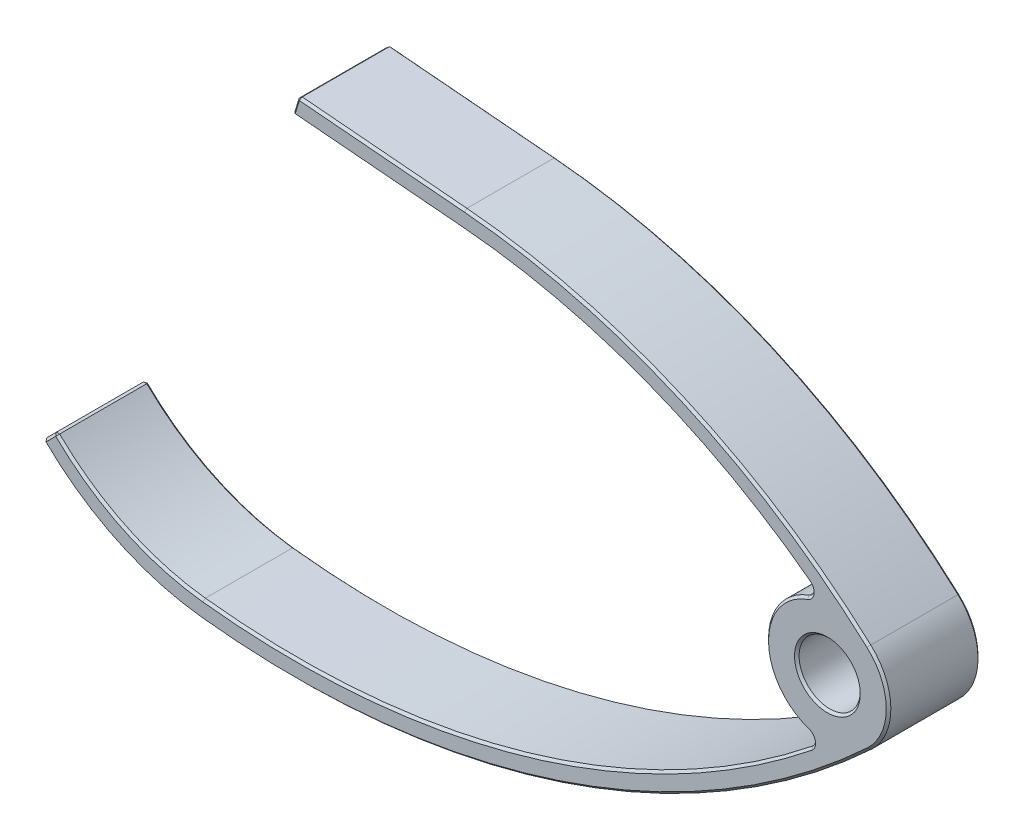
ISO-10303-21;
HEADER;
FILE_DESCRIPTION(('STEP AP214'),'2;1');
FILE_NAME('part.step','',(''),(''),'','','');
FILE_SCHEMA(('AUTOMOTIVE_DESIGN { 1 0 10303 214 1 1 1 1 }'));
ENDSEC;
DATA;
#1=APPLICATION_CONTEXT('core data for automotive mechanical design processes');
#2=APPLICATION_PROTOCOL_DEFINITION('international standard','automotive_design',2000,#1);
#3=PRODUCT_CONTEXT('',#1,'mechanical');
#4=PRODUCT('Part','Part','',(#3));
#5=PRODUCT_RELATED_PRODUCT_CATEGORY('part','',(#4));
#6=PRODUCT_DEFINITION_FORMATION('','',#4);
#7=PRODUCT_DEFINITION_CONTEXT('part definition',#1,'design');
#8=PRODUCT_DEFINITION('design','',#6,#7);
#9=PRODUCT_DEFINITION_SHAPE('','',#8);
#10=(LENGTH_UNIT() NAMED_UNIT(*) SI_UNIT(.MILLI.,.METRE.));
#11=(NAMED_UNIT(*) PLANE_ANGLE_UNIT() SI_UNIT($,.RADIAN.));
#12=(NAMED_UNIT(*) SI_UNIT($,.STERADIAN.) SOLID_ANGLE_UNIT());
#13=UNCERTAINTY_MEASURE_WITH_UNIT(LENGTH_MEASURE(1.E-05),#10,'distance_accuracy_value','');
#14=(GEOMETRIC_REPRESENTATION_CONTEXT(3) GLOBAL_UNCERTAINTY_ASSIGNED_CONTEXT((#13)) GLOBAL_UNIT_ASSIGNED_CONTEXT((#10,
#11,#12)) REPRESENTATION_CONTEXT('',''));
#15=CARTESIAN_POINT('',(0.,0.,0.));
#16=DIRECTION('',(0.,0.,1.));
#17=DIRECTION('',(1.,0.,0.));
#18=AXIS2_PLACEMENT_3D('',#15,#16,#17);
#19=CARTESIAN_POINT('',(11.431181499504,-30.3473268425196,6.));
#20=DIRECTION('',(0.,0.,-1.));
#21=DIRECTION('',(-1.,0.,0.));
#22=AXIS2_PLACEMENT_3D('',#19,#20,#21);
#23=CYLINDRICAL_SURFACE('',#22,43.8);
#24=DIRECTION('',(0.,0.,-1.));
#25=VECTOR('',#24,1.);
#26=CARTESIAN_POINT('',(15.1724427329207,13.2925971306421,6.));
#27=LINE('',#26,#25);
#28=CARTESIAN_POINT('',(15.1724427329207,13.2925971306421,5.85000000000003));
#29=VERTEX_POINT('',#28);
#30=CARTESIAN_POINT('',(15.1724427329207,13.2925971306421,0.14999999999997));
#31=VERTEX_POINT('',#30);
#32=EDGE_CURVE('E530',#29,#31,#27,.T.);
#33=ORIENTED_EDGE('',*,*,#32,.T.);
#34=CARTESIAN_POINT('',(11.431181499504,-30.3473268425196,0.14999999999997));
#35=DIRECTION('',(0.,0.,1.));
#36=DIRECTION('',(1.,0.,0.));
#37=AXIS2_PLACEMENT_3D('',#34,#35,#36);
#38=CIRCLE('',#37,43.8);
#39=CARTESIAN_POINT('',(37.7857419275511,4.63662868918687,0.14999999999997));
#40=VERTEX_POINT('',#39);
#41=EDGE_CURVE('E370',#31,#40,#38,.F.);
#42=ORIENTED_EDGE('',*,*,#41,.T.);
#43=DIRECTION('',(0.,0.,-1.));
#44=VECTOR('',#43,1.);
#45=CARTESIAN_POINT('',(37.7857419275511,4.63662868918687,6.));
#46=LINE('',#45,#44);
#47=CARTESIAN_POINT('',(37.7857419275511,4.63662868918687,5.85000000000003));
#48=VERTEX_POINT('',#47);
#49=EDGE_CURVE('E278',#48,#40,#46,.T.);
#50=ORIENTED_EDGE('',*,*,#49,.F.);
#51=CARTESIAN_POINT('',(11.431181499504,-30.3473268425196,5.85000000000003));
#52=DIRECTION('',(0.,0.,1.));
#53=DIRECTION('',(1.,0.,0.));
#54=AXIS2_PLACEMENT_3D('',#51,#52,#53);
#55=CIRCLE('',#54,43.8);
#56=EDGE_CURVE('E368',#48,#29,#55,.T.);
#57=ORIENTED_EDGE('',*,*,#56,.T.);
#58=EDGE_LOOP('',(#33,#42,#50,#57));
#59=FACE_BOUND('',#58,.T.);
#60=ADVANCED_FACE('F33',(#59),#23,.F.);
#61=CARTESIAN_POINT('',(37.4848907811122,4.23726846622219,6.));
#62=DIRECTION('',(0.,0.,-1.));
#63=DIRECTION('',(-1.,0.,0.));
#64=AXIS2_PLACEMENT_3D('',#61,#62,#63);
#65=CYLINDRICAL_SURFACE('',#64,0.5);
#66=ORIENTED_EDGE('',*,*,#49,.T.);
#67=CARTESIAN_POINT('',(37.4848907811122,4.23726846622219,0.14999999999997));
#68=DIRECTION('',(0.,0.,1.));
#69=DIRECTION('',(1.,0.,0.));
#70=AXIS2_PLACEMENT_3D('',#67,#68,#69);
#71=CIRCLE('',#70,0.5);
#72=CARTESIAN_POINT('',(37.6532362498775,3.76646085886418,0.14999999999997));
#73=VERTEX_POINT('',#72);
#74=EDGE_CURVE('E354',#40,#73,#71,.F.);
#75=ORIENTED_EDGE('',*,*,#74,.T.);
#76=DIRECTION('',(0.,0.,-1.));
#77=VECTOR('',#76,1.);
#78=CARTESIAN_POINT('',(37.6532362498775,3.76646085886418,6.));
#79=LINE('',#78,#77);
#80=CARTESIAN_POINT('',(37.6532362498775,3.76646085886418,5.85000000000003));
#81=VERTEX_POINT('',#80);
#82=EDGE_CURVE('E281',#81,#73,#79,.T.);
#83=ORIENTED_EDGE('',*,*,#82,.F.);
#84=CARTESIAN_POINT('',(37.4848907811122,4.23726846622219,5.85000000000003));
#85=DIRECTION('',(0.,0.,1.));
#86=DIRECTION('',(1.,0.,0.));
#87=AXIS2_PLACEMENT_3D('',#84,#85,#86);
#88=CIRCLE('',#87,0.5);
#89=EDGE_CURVE('E352',#81,#48,#88,.T.);
#90=ORIENTED_EDGE('',*,*,#89,.T.);
#91=EDGE_LOOP('',(#66,#75,#83,#90));
#92=FACE_BOUND('',#91,.T.);
#93=ADVANCED_FACE('F654',(#92),#65,.F.);
#94=CARTESIAN_POINT('',(39.,0.,6.));
#95=DIRECTION('',(0.,0.,-1.));
#96=DIRECTION('',(-1.,0.,0.));
#97=AXIS2_PLACEMENT_3D('',#94,#95,#96);
#98=CYLINDRICAL_SURFACE('',#97,3.99999999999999);
#99=ORIENTED_EDGE('',*,*,#82,.T.);
#100=CARTESIAN_POINT('',(39.,0.,0.14999999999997));
#101=DIRECTION('',(0.,0.,1.));
#102=DIRECTION('',(1.,0.,0.));
#103=AXIS2_PLACEMENT_3D('',#100,#101,#102);
#104=CIRCLE('',#103,3.99999999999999);
#105=CARTESIAN_POINT('',(37.7353608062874,-3.79482380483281,0.149999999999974));
#106=VERTEX_POINT('',#105);
#107=EDGE_CURVE('E358',#73,#106,#104,.T.);
#108=ORIENTED_EDGE('',*,*,#107,.T.);
#109=DIRECTION('',(0.,0.,-1.));
#110=VECTOR('',#109,1.);
#111=CARTESIAN_POINT('',(37.7353608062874,-3.79482380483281,6.));
#112=LINE('',#111,#110);
#113=CARTESIAN_POINT('',(37.7353608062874,-3.79482380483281,5.85000000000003));
#114=VERTEX_POINT('',#113);
#115=EDGE_CURVE('E556',#114,#106,#112,.T.);
#116=ORIENTED_EDGE('',*,*,#115,.F.);
#117=CARTESIAN_POINT('',(39.,0.,5.85000000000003));
#118=DIRECTION('',(0.,0.,1.));
#119=DIRECTION('',(1.,0.,0.));
#120=AXIS2_PLACEMENT_3D('',#117,#118,#119);
#121=CIRCLE('',#120,3.99999999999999);
#122=EDGE_CURVE('E356',#114,#81,#121,.F.);
#123=ORIENTED_EDGE('',*,*,#122,.T.);
#124=EDGE_LOOP('',(#99,#108,#116,#123));
#125=FACE_BOUND('',#124,.T.);
#126=ADVANCED_FACE('F562',(#125),#98,.T.);
#127=CARTESIAN_POINT('',(37.5772809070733,-4.26917678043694,6.));
#128=DIRECTION('',(0.,0.,-1.));
#129=DIRECTION('',(-1.,0.,0.));
#130=AXIS2_PLACEMENT_3D('',#127,#128,#129);
#131=CYLINDRICAL_SURFACE('',#130,0.499999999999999);
#132=ORIENTED_EDGE('',*,*,#115,.T.);
#133=CARTESIAN_POINT('',(37.5772809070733,-4.26917678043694,0.149999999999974));
#134=DIRECTION('',(0.,0.,1.));
#135=DIRECTION('',(1.,0.,0.));
#136=AXIS2_PLACEMENT_3D('',#133,#134,#135);
#137=CIRCLE('',#136,0.499999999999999);
#138=CARTESIAN_POINT('',(37.8900996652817,-4.65923373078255,0.149999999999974));
#139=VERTEX_POINT('',#138);
#140=EDGE_CURVE('E362',#106,#139,#137,.F.);
#141=ORIENTED_EDGE('',*,*,#140,.T.);
#142=DIRECTION('',(0.,0.,-1.));
#143=VECTOR('',#142,1.);
#144=CARTESIAN_POINT('',(37.8900996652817,-4.65923373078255,6.));
#145=LINE('',#144,#143);
#146=CARTESIAN_POINT('',(37.8900996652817,-4.65923373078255,5.85000000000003));
#147=VERTEX_POINT('',#146);
#148=EDGE_CURVE('E553',#147,#139,#145,.T.);
#149=ORIENTED_EDGE('',*,*,#148,.F.);
#150=CARTESIAN_POINT('',(37.5772809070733,-4.26917678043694,5.85000000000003));
#151=DIRECTION('',(0.,0.,1.));
#152=DIRECTION('',(1.,0.,0.));
#153=AXIS2_PLACEMENT_3D('',#150,#151,#152);
#154=CIRCLE('',#153,0.499999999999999);
#155=EDGE_CURVE('E360',#147,#114,#154,.T.);
#156=ORIENTED_EDGE('',*,*,#155,.T.);
#157=EDGE_LOOP('',(#132,#141,#149,#156));
#158=FACE_BOUND('',#157,.T.);
#159=ADVANCED_FACE('F588',(#158),#131,.F.);
#160=CARTESIAN_POINT('',(4.23080128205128,37.3108941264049,6.));
#161=DIRECTION('',(0.,0.,-1.));
#162=DIRECTION('',(-1.,0.,0.));
#163=AXIS2_PLACEMENT_3D('',#160,#161,#162);
#164=CYLINDRICAL_SURFACE('',#163,53.8);
#165=ORIENTED_EDGE('',*,*,#148,.T.);
#166=CARTESIAN_POINT('',(4.23080128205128,37.3108941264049,0.149999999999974));
#167=DIRECTION('',(0.,0.,1.));
#168=DIRECTION('',(1.,0.,0.));
#169=AXIS2_PLACEMENT_3D('',#166,#167,#168);
#170=CIRCLE('',#169,53.8);
#171=CARTESIAN_POINT('',(-1.83090601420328,-16.1465254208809,0.149999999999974));
#172=VERTEX_POINT('',#171);
#173=EDGE_CURVE('E366',#139,#172,#170,.F.);
#174=ORIENTED_EDGE('',*,*,#173,.T.);
#175=DIRECTION('',(0.,0.,-1.));
#176=VECTOR('',#175,1.);
#177=CARTESIAN_POINT('',(-1.83090601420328,-16.1465254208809,6.));
#178=LINE('',#177,#176);
#179=CARTESIAN_POINT('',(-1.83090601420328,-16.1465254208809,5.85000000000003));
#180=VERTEX_POINT('',#179);
#181=EDGE_CURVE('E550',#180,#172,#178,.T.);
#182=ORIENTED_EDGE('',*,*,#181,.F.);
#183=CARTESIAN_POINT('',(4.23080128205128,37.3108941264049,5.85000000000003));
#184=DIRECTION('',(0.,0.,1.));
#185=DIRECTION('',(1.,0.,0.));
#186=AXIS2_PLACEMENT_3D('',#183,#184,#185);
#187=CIRCLE('',#186,53.8);
#188=EDGE_CURVE('E364',#180,#147,#187,.T.);
#189=ORIENTED_EDGE('',*,*,#188,.T.);
#190=EDGE_LOOP('',(#165,#174,#182,#189));
#191=FACE_BOUND('',#190,.T.);
#192=ADVANCED_FACE('F592',(#191),#164,.F.);
#193=CARTESIAN_POINT('',(0.,0.,6.));
#194=DIRECTION('',(0.,0.,-1.));
#195=DIRECTION('',(-1.,0.,0.));
#196=AXIS2_PLACEMENT_3D('',#193,#194,#195);
#197=CYLINDRICAL_SURFACE('',#196,16.25);
#198=ORIENTED_EDGE('',*,*,#181,.T.);
#199=CARTESIAN_POINT('',(0.,0.,0.149999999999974));
#200=DIRECTION('',(0.,0.,1.));
#201=DIRECTION('',(1.,0.,0.));
#202=AXIS2_PLACEMENT_3D('',#199,#200,#201);
#203=CIRCLE('',#202,16.25);
#204=CARTESIAN_POINT('',(-11.3646540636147,-11.614953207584,0.149999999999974));
#205=VERTEX_POINT('',#204);
#206=EDGE_CURVE('E350',#172,#205,#203,.F.);
#207=ORIENTED_EDGE('',*,*,#206,.T.);
#208=DIRECTION('',(0.,0.,-1.));
#209=VECTOR('',#208,1.);
#210=CARTESIAN_POINT('',(-11.3646540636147,-11.614953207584,6.));
#211=LINE('',#210,#209);
#212=CARTESIAN_POINT('',(-11.3646540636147,-11.614953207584,5.85000000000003));
#213=VERTEX_POINT('',#212);
#214=EDGE_CURVE('E348',#205,#213,#211,.F.);
#215=ORIENTED_EDGE('',*,*,#214,.T.);
#216=CARTESIAN_POINT('',(0.,0.,5.85000000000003));
#217=DIRECTION('',(0.,0.,1.));
#218=DIRECTION('',(1.,0.,0.));
#219=AXIS2_PLACEMENT_3D('',#216,#217,#218);
#220=CIRCLE('',#219,16.25);
#221=EDGE_CURVE('E346',#213,#180,#220,.T.);
#222=ORIENTED_EDGE('',*,*,#221,.T.);
#223=EDGE_LOOP('',(#198,#207,#215,#222));
#224=FACE_BOUND('',#223,.T.);
#225=ADVANCED_FACE('F605',(#224),#197,.F.);
#226=CARTESIAN_POINT('',(-18.0662514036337,-18.1294248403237,6.));
#227=DIRECTION('',(0.708339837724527,-0.705871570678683,0.));
#228=DIRECTION('',(0.705871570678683,0.708339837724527,0.));
#229=AXIS2_PLACEMENT_3D('',#226,#227,#228);
#230=PLANE('',#229);
#231=DIRECTION('',(0.705871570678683,0.708339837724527,0.));
#232=VECTOR('',#231,1.);
#233=CARTESIAN_POINT('',(-11.4704130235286,-11.5105223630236,5.85000000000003));
#234=LINE('',#233,#232);
#235=CARTESIAN_POINT('',(-12.2111191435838,-12.2538185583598,5.85000000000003));
#236=VERTEX_POINT('',#235);
#237=CARTESIAN_POINT('',(-11.5758095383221,-11.6162874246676,5.85000000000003));
#238=VERTEX_POINT('',#237);
#239=EDGE_CURVE('E337',#236,#238,#234,.T.);
#240=ORIENTED_EDGE('',*,*,#239,.T.);
#241=DIRECTION('',(0.,0.,-1.));
#242=VECTOR('',#241,1.);
#243=CARTESIAN_POINT('',(-11.5758095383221,-11.6162874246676,0.));
#244=LINE('',#243,#242);
#245=CARTESIAN_POINT('',(-11.5758095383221,-11.6162874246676,0.149999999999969));
#246=VERTEX_POINT('',#245);
#247=EDGE_CURVE('E343',#238,#246,#244,.T.);
#248=ORIENTED_EDGE('',*,*,#247,.T.);
#249=DIRECTION('',(-0.705871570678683,-0.708339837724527,0.));
#250=VECTOR('',#249,1.);
#251=CARTESIAN_POINT('',(-18.0662514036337,-18.1294248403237,0.149999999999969));
#252=LINE('',#251,#250);
#253=CARTESIAN_POINT('',(-12.2111191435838,-12.2538185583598,0.149999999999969));
#254=VERTEX_POINT('',#253);
#255=EDGE_CURVE('E341',#246,#254,#252,.T.);
#256=ORIENTED_EDGE('',*,*,#255,.T.);
#257=DIRECTION('',(0.,0.,1.));
#258=VECTOR('',#257,1.);
#259=CARTESIAN_POINT('',(-12.2111191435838,-12.2538185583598,6.));
#260=LINE('',#259,#258);
#261=EDGE_CURVE('E339',#254,#236,#260,.T.);
#262=ORIENTED_EDGE('',*,*,#261,.T.);
#263=EDGE_LOOP('',(#240,#248,#256,#262));
#264=FACE_BOUND('',#263,.T.);
#265=ADVANCED_FACE('F612',(#264),#230,.F.);
#266=CARTESIAN_POINT('',(0.,0.,6.));
#267=DIRECTION('',(0.,0.,-1.));
#268=DIRECTION('',(-1.,0.,0.));
#269=AXIS2_PLACEMENT_3D('',#266,#267,#268);
#270=CYLINDRICAL_SURFACE('',#269,17.45);
#271=DIRECTION('',(0.,0.,-1.));
#272=VECTOR('',#271,1.);
#273=CARTESIAN_POINT('',(-12.2098236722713,-12.4668643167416,6.));
#274=LINE('',#273,#272);
#275=CARTESIAN_POINT('',(-12.2098236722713,-12.4668643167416,5.85000000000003));
#276=VERTEX_POINT('',#275);
#277=CARTESIAN_POINT('',(-12.2098236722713,-12.4668643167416,0.14999999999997));
#278=VERTEX_POINT('',#277);
#279=EDGE_CURVE('E386',#276,#278,#274,.T.);
#280=ORIENTED_EDGE('',*,*,#279,.T.);
#281=CARTESIAN_POINT('',(0.,0.,0.14999999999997));
#282=DIRECTION('',(0.,0.,1.));
#283=DIRECTION('',(1.,0.,0.));
#284=AXIS2_PLACEMENT_3D('',#281,#282,#283);
#285=CIRCLE('',#284,17.45);
#286=CARTESIAN_POINT('',(-1.96611138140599,-17.3388842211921,0.14999999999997));
#287=VERTEX_POINT('',#286);
#288=EDGE_CURVE('E388',#278,#287,#285,.T.);
#289=ORIENTED_EDGE('',*,*,#288,.T.);
#290=DIRECTION('',(0.,0.,-1.));
#291=VECTOR('',#290,1.);
#292=CARTESIAN_POINT('',(-1.96611138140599,-17.3388842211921,6.));
#293=LINE('',#292,#291);
#294=CARTESIAN_POINT('',(-1.96611138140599,-17.3388842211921,5.85000000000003));
#295=VERTEX_POINT('',#294);
#296=EDGE_CURVE('E547',#295,#287,#293,.T.);
#297=ORIENTED_EDGE('',*,*,#296,.F.);
#298=CARTESIAN_POINT('',(0.,0.,5.85000000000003));
#299=DIRECTION('',(0.,0.,1.));
#300=DIRECTION('',(1.,0.,0.));
#301=AXIS2_PLACEMENT_3D('',#298,#299,#300);
#302=CIRCLE('',#301,17.45);
#303=EDGE_CURVE('E384',#295,#276,#302,.F.);
#304=ORIENTED_EDGE('',*,*,#303,.T.);
#305=EDGE_LOOP('',(#280,#289,#297,#304));
#306=FACE_BOUND('',#305,.T.);
#307=ADVANCED_FACE('F1109',(#306),#270,.T.);
#308=CARTESIAN_POINT('',(4.23080128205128,37.3108941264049,6.));
#309=DIRECTION('',(0.,0.,-1.));
#310=DIRECTION('',(-1.,0.,0.));
#311=AXIS2_PLACEMENT_3D('',#308,#309,#310);
#312=CYLINDRICAL_SURFACE('',#311,55.);
#313=ORIENTED_EDGE('',*,*,#296,.T.);
#314=CARTESIAN_POINT('',(4.23080128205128,37.3108941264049,0.14999999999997));
#315=DIRECTION('',(0.,0.,1.));
#316=DIRECTION('',(1.,0.,0.));
#317=AXIS2_PLACEMENT_3D('',#314,#315,#316);
#318=CIRCLE('',#317,55.);
#319=CARTESIAN_POINT('',(41.7269959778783,-2.92634463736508,0.14999999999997));
#320=VERTEX_POINT('',#319);
#321=EDGE_CURVE('E382',#287,#320,#318,.T.);
#322=ORIENTED_EDGE('',*,*,#321,.T.);
#323=DIRECTION('',(0.,0.,-1.));
#324=VECTOR('',#323,1.);
#325=CARTESIAN_POINT('',(41.7269959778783,-2.92634463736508,6.));
#326=LINE('',#325,#324);
#327=CARTESIAN_POINT('',(41.7269959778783,-2.92634463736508,5.85000000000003));
#328=VERTEX_POINT('',#327);
#329=EDGE_CURVE('E544',#328,#320,#326,.T.);
#330=ORIENTED_EDGE('',*,*,#329,.F.);
#331=CARTESIAN_POINT('',(4.23080128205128,37.3108941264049,5.85000000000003));
#332=DIRECTION('',(0.,0.,1.));
#333=DIRECTION('',(1.,0.,0.));
#334=AXIS2_PLACEMENT_3D('',#331,#332,#333);
#335=CIRCLE('',#334,55.);
#336=EDGE_CURVE('E380',#328,#295,#335,.F.);
#337=ORIENTED_EDGE('',*,*,#336,.T.);
#338=EDGE_LOOP('',(#313,#322,#330,#337));
#339=FACE_BOUND('',#338,.T.);
#340=ADVANCED_FACE('F1100',(#339),#312,.T.);
#341=CARTESIAN_POINT('',(39.,0.,6.));
#342=DIRECTION('',(0.,0.,-1.));
#343=DIRECTION('',(-1.,0.,0.));
#344=AXIS2_PLACEMENT_3D('',#341,#342,#343);
#345=CYLINDRICAL_SURFACE('',#344,4.);
#346=ORIENTED_EDGE('',*,*,#329,.T.);
#347=CARTESIAN_POINT('',(39.,0.,0.14999999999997));
#348=DIRECTION('',(0.,0.,1.));
#349=DIRECTION('',(1.,0.,0.));
#350=AXIS2_PLACEMENT_3D('',#347,#348,#349);
#351=CIRCLE('',#350,4.);
#352=CARTESIAN_POINT('',(41.6896408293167,2.96071481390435,0.14999999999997));
#353=VERTEX_POINT('',#352);
#354=EDGE_CURVE('E378',#320,#353,#351,.T.);
#355=ORIENTED_EDGE('',*,*,#354,.T.);
#356=DIRECTION('',(0.,0.,-1.));
#357=VECTOR('',#356,1.);
#358=CARTESIAN_POINT('',(41.6896408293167,2.96071481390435,6.));
#359=LINE('',#358,#357);
#360=CARTESIAN_POINT('',(41.6896408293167,2.96071481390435,5.85000000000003));
#361=VERTEX_POINT('',#360);
#362=EDGE_CURVE('E539',#361,#353,#359,.T.);
#363=ORIENTED_EDGE('',*,*,#362,.F.);
#364=CARTESIAN_POINT('',(39.,0.,5.85000000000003));
#365=DIRECTION('',(0.,0.,1.));
#366=DIRECTION('',(1.,0.,0.));
#367=AXIS2_PLACEMENT_3D('',#364,#365,#366);
#368=CIRCLE('',#367,4.);
#369=EDGE_CURVE('E376',#361,#328,#368,.F.);
#370=ORIENTED_EDGE('',*,*,#369,.T.);
#371=EDGE_LOOP('',(#346,#355,#363,#370));
#372=FACE_BOUND('',#371,.T.);
#373=ADVANCED_FACE('F1091',(#372),#345,.T.);
#374=CARTESIAN_POINT('',(11.431181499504,-30.3473268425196,6.));
#375=DIRECTION('',(0.,0.,-1.));
#376=DIRECTION('',(-1.,0.,0.));
#377=AXIS2_PLACEMENT_3D('',#374,#375,#376);
#378=CYLINDRICAL_SURFACE('',#377,45.);
#379=ORIENTED_EDGE('',*,*,#362,.T.);
#380=CARTESIAN_POINT('',(11.431181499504,-30.3473268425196,0.14999999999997));
#381=DIRECTION('',(0.,0.,1.));
#382=DIRECTION('',(1.,0.,0.));
#383=AXIS2_PLACEMENT_3D('',#380,#381,#382);
#384=CIRCLE('',#383,45.);
#385=CARTESIAN_POINT('',(15.2749430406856,14.4882114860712,0.14999999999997));
#386=VERTEX_POINT('',#385);
#387=EDGE_CURVE('E374',#353,#386,#384,.T.);
#388=ORIENTED_EDGE('',*,*,#387,.T.);
#389=DIRECTION('',(0.,0.,-1.));
#390=VECTOR('',#389,1.);
#391=CARTESIAN_POINT('',(15.2749430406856,14.4882114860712,6.));
#392=LINE('',#391,#390);
#393=CARTESIAN_POINT('',(15.2749430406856,14.4882114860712,5.85000000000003));
#394=VERTEX_POINT('',#393);
#395=EDGE_CURVE('E533',#394,#386,#392,.T.);
#396=ORIENTED_EDGE('',*,*,#395,.F.);
#397=CARTESIAN_POINT('',(11.431181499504,-30.3473268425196,5.85000000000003));
#398=DIRECTION('',(0.,0.,1.));
#399=DIRECTION('',(1.,0.,0.));
#400=AXIS2_PLACEMENT_3D('',#397,#398,#399);
#401=CIRCLE('',#400,45.);
#402=EDGE_CURVE('E372',#394,#361,#401,.F.);
#403=ORIENTED_EDGE('',*,*,#402,.T.);
#404=EDGE_LOOP('',(#379,#388,#396,#403));
#405=FACE_BOUND('',#404,.T.);
#406=ADVANCED_FACE('F1082',(#405),#378,.T.);
#407=CARTESIAN_POINT('',(20.949934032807,14.0016931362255,6.));
#408=DIRECTION('',(0.0854169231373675,0.996345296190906,0.));
#409=DIRECTION('',(-0.996345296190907,0.0854169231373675,0.));
#410=AXIS2_PLACEMENT_3D('',#407,#408,#409);
#411=PLANE('',#410);
#412=ORIENTED_EDGE('',*,*,#395,.T.);
#413=DIRECTION('',(-0.996345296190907,0.0854169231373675,0.));
#414=VECTOR('',#413,1.);
#415=CARTESIAN_POINT('',(4.35445577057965,15.424427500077,0.149999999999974));
#416=LINE('',#415,#414);
#417=CARTESIAN_POINT('',(4.50390756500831,15.4116149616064,0.149999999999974));
#418=VERTEX_POINT('',#417);
#419=EDGE_CURVE('E292',#386,#418,#416,.T.);
#420=ORIENTED_EDGE('',*,*,#419,.T.);
#421=DIRECTION('',(0.,0.,1.));
#422=VECTOR('',#421,1.);
#423=CARTESIAN_POINT('',(4.50390756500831,15.4116149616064,6.));
#424=LINE('',#423,#422);
#425=CARTESIAN_POINT('',(4.50390756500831,15.4116149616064,5.85000000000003));
#426=VERTEX_POINT('',#425);
#427=EDGE_CURVE('E289',#418,#426,#424,.T.);
#428=ORIENTED_EDGE('',*,*,#427,.T.);
#429=DIRECTION('',(0.996345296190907,-0.0854169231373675,0.));
#430=VECTOR('',#429,1.);
#431=CARTESIAN_POINT('',(20.949934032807,14.0016931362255,5.85000000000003));
#432=LINE('',#431,#430);
#433=EDGE_CURVE('E287',#426,#394,#432,.T.);
#434=ORIENTED_EDGE('',*,*,#433,.T.);
#435=EDGE_LOOP('',(#412,#420,#428,#434));
#436=FACE_BOUND('',#435,.T.);
#437=ADVANCED_FACE('F1074',(#436),#411,.T.);
#438=CARTESIAN_POINT('',(-13.2234313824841,-42.7963436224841,6.));
#439=DIRECTION('',(-0.957319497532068,0.289031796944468,0.));
#440=DIRECTION('',(-0.289031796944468,-0.957319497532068,0.));
#441=AXIS2_PLACEMENT_3D('',#438,#439,#440);
#442=PLANE('',#441);
#443=DIRECTION('',(0.,0.,-1.));
#444=VECTOR('',#443,1.);
#445=CARTESIAN_POINT('',(4.29831890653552,15.2384932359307,6.));
#446=LINE('',#445,#444);
#447=CARTESIAN_POINT('',(4.29831890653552,15.2384932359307,5.85000000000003));
#448=VERTEX_POINT('',#447);
#449=CARTESIAN_POINT('',(4.29831890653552,15.2384932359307,0.149999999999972));
#450=VERTEX_POINT('',#449);
#451=EDGE_CURVE('E252',#448,#450,#446,.T.);
#452=ORIENTED_EDGE('',*,*,#451,.T.);
#453=DIRECTION('',(-0.289031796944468,-0.957319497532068,0.));
#454=VECTOR('',#453,1.);
#455=CARTESIAN_POINT('',(4.,14.2504133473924,0.149999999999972));
#456=LINE('',#455,#454);
#457=CARTESIAN_POINT('',(4.04335476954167,14.3940112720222,0.149999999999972));
#458=VERTEX_POINT('',#457);
#459=EDGE_CURVE('E248',#450,#458,#456,.T.);
#460=ORIENTED_EDGE('',*,*,#459,.T.);
#461=DIRECTION('',(0.,0.,1.));
#462=VECTOR('',#461,1.);
#463=CARTESIAN_POINT('',(4.04335476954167,14.3940112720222,6.));
#464=LINE('',#463,#462);
#465=CARTESIAN_POINT('',(4.04335476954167,14.3940112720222,5.85000000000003));
#466=VERTEX_POINT('',#465);
#467=EDGE_CURVE('E240',#458,#466,#464,.T.);
#468=ORIENTED_EDGE('',*,*,#467,.T.);
#469=DIRECTION('',(0.289031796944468,0.957319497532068,0.));
#470=VECTOR('',#469,1.);
#471=CARTESIAN_POINT('',(-13.2234313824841,-42.7963436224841,5.85000000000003));
#472=LINE('',#471,#470);
#473=EDGE_CURVE('E245',#466,#448,#472,.T.);
#474=ORIENTED_EDGE('',*,*,#473,.T.);
#475=EDGE_LOOP('',(#452,#460,#468,#474));
#476=FACE_BOUND('',#475,.T.);
#477=ADVANCED_FACE('F243',(#476),#442,.T.);
#478=CARTESIAN_POINT('',(39.,0.,6.));
#479=DIRECTION('',(0.,0.,-1.));
#480=DIRECTION('',(-1.,0.,0.));
#481=AXIS2_PLACEMENT_3D('',#478,#479,#480);
#482=CYLINDRICAL_SURFACE('',#481,2.);
#483=CARTESIAN_POINT('',(39.,0.,0.150000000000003));
#484=DIRECTION('',(0.,0.,1.));
#485=DIRECTION('',(1.,0.,0.));
#486=AXIS2_PLACEMENT_3D('',#483,#484,#485);
#487=CIRCLE('',#486,2.);
#488=CARTESIAN_POINT('',(41.,0.,0.150000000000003));
#489=VERTEX_POINT('',#488);
#490=EDGE_CURVE('E334',#489,#489,#487,.F.);
#491=ORIENTED_EDGE('',*,*,#490,.T.);
#492=EDGE_LOOP('',(#491));
#493=FACE_BOUND('',#492,.T.);
#494=CARTESIAN_POINT('',(39.,0.,5.84999999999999));
#495=DIRECTION('',(0.,0.,1.));
#496=DIRECTION('',(1.,0.,0.));
#497=AXIS2_PLACEMENT_3D('',#494,#495,#496);
#498=CIRCLE('',#497,2.);
#499=CARTESIAN_POINT('',(41.,0.,5.84999999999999));
#500=VERTEX_POINT('',#499);
#501=EDGE_CURVE('E331',#500,#500,#498,.T.);
#502=ORIENTED_EDGE('',*,*,#501,.T.);
#503=EDGE_LOOP('',(#502));
#504=FACE_BOUND('',#503,.T.);
#505=ADVANCED_FACE('F662',(#493,#504),#482,.F.);
#506=CARTESIAN_POINT('',(20.8474337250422,12.8060787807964,6.));
#507=DIRECTION('',(0.0854169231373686,0.996345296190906,0.));
#508=DIRECTION('',(-0.996345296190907,0.0854169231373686,0.));
#509=AXIS2_PLACEMENT_3D('',#506,#507,#508);
#510=PLANE('',#509);
#511=DIRECTION('',(0.,0.,-1.));
#512=VECTOR('',#511,1.);
#513=CARTESIAN_POINT('',(4.12615019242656,14.2395984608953,0.));
#514=LINE('',#513,#512);
#515=CARTESIAN_POINT('',(4.12615019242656,14.2395984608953,5.85000000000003));
#516=VERTEX_POINT('',#515);
#517=CARTESIAN_POINT('',(4.12615019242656,14.2395984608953,0.149999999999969));
#518=VERTEX_POINT('',#517);
#519=EDGE_CURVE('E260',#516,#518,#514,.T.);
#520=ORIENTED_EDGE('',*,*,#519,.T.);
#521=DIRECTION('',(0.996345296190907,-0.0854169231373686,0.));
#522=VECTOR('',#521,1.);
#523=CARTESIAN_POINT('',(20.8474337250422,12.8060787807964,0.14999999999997));
#524=LINE('',#523,#522);
#525=EDGE_CURVE('E297',#518,#31,#524,.T.);
#526=ORIENTED_EDGE('',*,*,#525,.T.);
#527=ORIENTED_EDGE('',*,*,#32,.F.);
#528=DIRECTION('',(-0.996345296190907,0.0854169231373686,0.));
#529=VECTOR('',#528,1.);
#530=CARTESIAN_POINT('',(4.,14.2504133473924,5.85000000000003));
#531=LINE('',#530,#529);
#532=EDGE_CURVE('E294',#29,#516,#531,.T.);
#533=ORIENTED_EDGE('',*,*,#532,.T.);
#534=EDGE_LOOP('',(#520,#526,#527,#533));
#535=FACE_BOUND('',#534,.T.);
#536=ADVANCED_FACE('F665',(#535),#510,.F.);
#537=CARTESIAN_POINT('',(15.3412705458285,-51.4205355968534,6.));
#538=DIRECTION('',(0.,0.,1.));
#539=DIRECTION('',(1.,0.,0.));
#540=AXIS2_PLACEMENT_3D('',#537,#538,#539);
#541=PLANE('',#540);
#542=DIRECTION('',(-0.289031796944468,-0.957319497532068,0.));
#543=VECTOR('',#542,1.);
#544=CARTESIAN_POINT('',(-13.0798334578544,-42.8396983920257,6.));
#545=LINE('',#544,#543);
#546=CARTESIAN_POINT('',(4.46288300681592,15.2645817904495,6.));
#547=VERTEX_POINT('',#546);
#548=CARTESIAN_POINT('',(4.19704117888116,14.3840711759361,6.));
#549=VERTEX_POINT('',#548);
#550=EDGE_CURVE('E42',#547,#549,#545,.T.);
#551=ORIENTED_EDGE('',*,*,#550,.T.);
#552=DIRECTION('',(0.996345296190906,-0.0854169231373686,0.));
#553=VECTOR('',#552,1.);
#554=CARTESIAN_POINT('',(15.1852552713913,13.4420489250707,6.));
#555=LINE('',#554,#553);
#556=CARTESIAN_POINT('',(15.1852552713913,13.4420489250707,6.));
#557=VERTEX_POINT('',#556);
#558=EDGE_CURVE('E11',#549,#557,#555,.T.);
#559=ORIENTED_EDGE('',*,*,#558,.T.);
#560=CARTESIAN_POINT('',(11.431181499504,-30.3473268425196,6.));
#561=DIRECTION('',(0.,0.,1.));
#562=DIRECTION('',(1.,0.,0.));
#563=AXIS2_PLACEMENT_3D('',#560,#561,#562);
#564=CIRCLE('',#563,43.95);
#565=CARTESIAN_POINT('',(37.8759972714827,4.75643675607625,6.));
#566=VERTEX_POINT('',#565);
#567=EDGE_CURVE('E393',#557,#566,#564,.F.);
#568=ORIENTED_EDGE('',*,*,#567,.T.);
#569=CARTESIAN_POINT('',(37.4848907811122,4.23726846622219,6.));
#570=DIRECTION('',(0.,0.,1.));
#571=DIRECTION('',(1.,0.,0.));
#572=AXIS2_PLACEMENT_3D('',#569,#570,#571);
#573=CIRCLE('',#572,0.649999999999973);
#574=CARTESIAN_POINT('',(37.7037398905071,3.62521857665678,6.));
#575=VERTEX_POINT('',#574);
#576=EDGE_CURVE('E395',#566,#575,#573,.F.);
#577=ORIENTED_EDGE('',*,*,#576,.T.);
#578=CARTESIAN_POINT('',(39.,0.,6.));
#579=DIRECTION('',(0.,0.,1.));
#580=DIRECTION('',(1.,0.,0.));
#581=AXIS2_PLACEMENT_3D('',#578,#579,#580);
#582=CIRCLE('',#581,3.85000000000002);
#583=CARTESIAN_POINT('',(37.7827847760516,-3.65251791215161,6.));
#584=VERTEX_POINT('',#583);
#585=EDGE_CURVE('E397',#575,#584,#582,.T.);
#586=ORIENTED_EDGE('',*,*,#585,.T.);
#587=CARTESIAN_POINT('',(37.5772809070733,-4.26917678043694,6.));
#588=DIRECTION('',(0.,0.,1.));
#589=DIRECTION('',(1.,0.,0.));
#590=AXIS2_PLACEMENT_3D('',#587,#588,#589);
#591=CIRCLE('',#590,0.649999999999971);
#592=CARTESIAN_POINT('',(37.9839452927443,-4.77625081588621,6.));
#593=VERTEX_POINT('',#592);
#594=EDGE_CURVE('E399',#584,#593,#591,.F.);
#595=ORIENTED_EDGE('',*,*,#594,.T.);
#596=CARTESIAN_POINT('',(4.23080128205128,37.3108941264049,6.));
#597=DIRECTION('',(0.,0.,1.));
#598=DIRECTION('',(1.,0.,0.));
#599=AXIS2_PLACEMENT_3D('',#596,#597,#598);
#600=CIRCLE('',#599,53.95);
#601=CARTESIAN_POINT('',(-1.84780668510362,-16.2955702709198,6.));
#602=VERTEX_POINT('',#601);
#603=EDGE_CURVE('E401',#593,#602,#600,.F.);
#604=ORIENTED_EDGE('',*,*,#603,.T.);
#605=CARTESIAN_POINT('',(0.,0.,6.));
#606=DIRECTION('',(0.,0.,1.));
#607=DIRECTION('',(1.,0.,0.));
#608=AXIS2_PLACEMENT_3D('',#605,#606,#607);
#609=CIRCLE('',#608,16.4);
#610=CARTESIAN_POINT('',(-11.4695585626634,-11.7221681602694,6.));
#611=VERTEX_POINT('',#610);
#612=EDGE_CURVE('E403',#602,#611,#609,.F.);
#613=ORIENTED_EDGE('',*,*,#612,.T.);
#614=DIRECTION('',(-0.705871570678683,-0.708339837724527,0.));
#615=VECTOR('',#614,1.);
#616=CARTESIAN_POINT('',(-12.2112079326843,-12.4664109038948,6.));
#617=LINE('',#616,#615);
#618=CARTESIAN_POINT('',(-12.1048681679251,-12.3596992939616,6.));
#619=VERTEX_POINT('',#618);
#620=EDGE_CURVE('E405',#611,#619,#617,.T.);
#621=ORIENTED_EDGE('',*,*,#620,.T.);
#622=CARTESIAN_POINT('',(0.,0.,6.));
#623=DIRECTION('',(0.,0.,1.));
#624=DIRECTION('',(1.,0.,0.));
#625=AXIS2_PLACEMENT_3D('',#622,#623,#624);
#626=CIRCLE('',#625,17.3);
#627=CARTESIAN_POINT('',(-1.94921071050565,-17.1898393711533,6.));
#628=VERTEX_POINT('',#627);
#629=EDGE_CURVE('E407',#619,#628,#626,.T.);
#630=ORIENTED_EDGE('',*,*,#629,.T.);
#631=CARTESIAN_POINT('',(4.23080128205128,37.3108941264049,6.));
#632=DIRECTION('',(0.,0.,1.));
#633=DIRECTION('',(1.,0.,0.));
#634=AXIS2_PLACEMENT_3D('',#631,#632,#633);
#635=CIRCLE('',#634,54.85);
#636=CARTESIAN_POINT('',(41.6247336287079,-2.81660671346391,6.));
#637=VERTEX_POINT('',#636);
#638=EDGE_CURVE('E409',#628,#637,#635,.T.);
#639=ORIENTED_EDGE('',*,*,#638,.T.);
#640=CARTESIAN_POINT('',(39.,0.,6.));
#641=DIRECTION('',(0.,0.,1.));
#642=DIRECTION('',(1.,0.,0.));
#643=AXIS2_PLACEMENT_3D('',#640,#641,#642);
#644=CIRCLE('',#643,3.85000000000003);
#645=CARTESIAN_POINT('',(41.5887792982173,2.84968800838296,6.));
#646=VERTEX_POINT('',#645);
#647=EDGE_CURVE('E411',#637,#646,#644,.T.);
#648=ORIENTED_EDGE('',*,*,#647,.T.);
#649=CARTESIAN_POINT('',(11.431181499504,-30.3473268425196,6.));
#650=DIRECTION('',(0.,0.,1.));
#651=DIRECTION('',(1.,0.,0.));
#652=AXIS2_PLACEMENT_3D('',#649,#650,#651);
#653=CIRCLE('',#652,44.85);
#654=CARTESIAN_POINT('',(15.262130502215,14.3387596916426,6.));
#655=VERTEX_POINT('',#654);
#656=EDGE_CURVE('E413',#646,#655,#653,.T.);
#657=ORIENTED_EDGE('',*,*,#656,.T.);
#658=DIRECTION('',(-0.996345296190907,0.0854169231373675,0.));
#659=VECTOR('',#658,1.);
#660=CARTESIAN_POINT('',(20.9371214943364,13.8522413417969,6.));
#661=LINE('',#660,#659);
#662=EDGE_CURVE('E53',#655,#547,#661,.T.);
#663=ORIENTED_EDGE('',*,*,#662,.T.);
#664=EDGE_LOOP('',(#551,#559,#568,#577,#586,#595,#604,#613,#621,#630,#639,#648,#657,#663));
#665=FACE_BOUND('',#664,.T.);
#666=CARTESIAN_POINT('',(39.,0.,6.));
#667=DIRECTION('',(0.,0.,1.));
#668=DIRECTION('',(1.,0.,0.));
#669=AXIS2_PLACEMENT_3D('',#666,#667,#668);
#670=CIRCLE('',#669,2.15000000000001);
#671=CARTESIAN_POINT('',(41.15,0.,6.));
#672=VERTEX_POINT('',#671);
#673=EDGE_CURVE('E390',#672,#672,#670,.F.);
#674=ORIENTED_EDGE('',*,*,#673,.T.);
#675=EDGE_LOOP('',(#674));
#676=FACE_BOUND('',#675,.T.);
#677=ADVANCED_FACE('F634',(#665,#676),#541,.T.);
#678=CARTESIAN_POINT('',(15.3412705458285,-51.4205355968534,0.));
#679=DIRECTION('',(0.,0.,1.));
#680=DIRECTION('',(1.,0.,0.));
#681=AXIS2_PLACEMENT_3D('',#678,#679,#680);
#682=PLANE('',#681);
#683=CARTESIAN_POINT('',(39.,0.,0.));
#684=DIRECTION('',(0.,0.,1.));
#685=DIRECTION('',(1.,0.,0.));
#686=AXIS2_PLACEMENT_3D('',#683,#684,#685);
#687=CIRCLE('',#686,2.15000000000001);
#688=CARTESIAN_POINT('',(41.15,0.,0.));
#689=VERTEX_POINT('',#688);
#690=EDGE_CURVE('E328',#689,#689,#687,.T.);
#691=ORIENTED_EDGE('',*,*,#690,.T.);
#692=EDGE_LOOP('',(#691));
#693=FACE_BOUND('',#692,.T.);
#694=CARTESIAN_POINT('',(39.,0.,0.));
#695=DIRECTION('',(0.,0.,1.));
#696=DIRECTION('',(1.,0.,0.));
#697=AXIS2_PLACEMENT_3D('',#694,#695,#696);
#698=CIRCLE('',#697,3.85000000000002);
#699=CARTESIAN_POINT('',(37.7827847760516,-3.65251791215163,0.));
#700=VERTEX_POINT('',#699);
#701=CARTESIAN_POINT('',(37.7037398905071,3.6252185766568,0.));
#702=VERTEX_POINT('',#701);
#703=EDGE_CURVE('E323',#700,#702,#698,.F.);
#704=ORIENTED_EDGE('',*,*,#703,.T.);
#705=CARTESIAN_POINT('',(37.4848907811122,4.23726846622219,0.));
#706=DIRECTION('',(0.,0.,1.));
#707=DIRECTION('',(1.,0.,0.));
#708=AXIS2_PLACEMENT_3D('',#705,#706,#707);
#709=CIRCLE('',#708,0.649999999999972);
#710=CARTESIAN_POINT('',(37.8759972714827,4.75643675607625,0.));
#711=VERTEX_POINT('',#710);
#712=EDGE_CURVE('E325',#702,#711,#709,.T.);
#713=ORIENTED_EDGE('',*,*,#712,.T.);
#714=CARTESIAN_POINT('',(11.431181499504,-30.3473268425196,0.));
#715=DIRECTION('',(0.,0.,1.));
#716=DIRECTION('',(1.,0.,0.));
#717=AXIS2_PLACEMENT_3D('',#714,#715,#716);
#718=CIRCLE('',#717,43.95);
#719=CARTESIAN_POINT('',(15.1852552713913,13.4420489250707,0.));
#720=VERTEX_POINT('',#719);
#721=EDGE_CURVE('E313',#711,#720,#718,.T.);
#722=ORIENTED_EDGE('',*,*,#721,.T.);
#723=DIRECTION('',(-0.996345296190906,0.0854169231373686,0.));
#724=VECTOR('',#723,1.);
#725=CARTESIAN_POINT('',(20.8602462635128,12.955530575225,0.));
#726=LINE('',#725,#724);
#727=CARTESIAN_POINT('',(4.19704117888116,14.3840711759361,0.));
#728=VERTEX_POINT('',#727);
#729=EDGE_CURVE('E311',#720,#728,#726,.T.);
#730=ORIENTED_EDGE('',*,*,#729,.T.);
#731=DIRECTION('',(0.289031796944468,0.957319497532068,0.));
#732=VECTOR('',#731,1.);
#733=CARTESIAN_POINT('',(4.49805369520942,15.3810727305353,0.));
#734=LINE('',#733,#732);
#735=CARTESIAN_POINT('',(4.46288300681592,15.2645817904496,0.));
#736=VERTEX_POINT('',#735);
#737=EDGE_CURVE('E309',#728,#736,#734,.T.);
#738=ORIENTED_EDGE('',*,*,#737,.T.);
#739=DIRECTION('',(0.996345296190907,-0.0854169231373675,0.));
#740=VECTOR('',#739,1.);
#741=CARTESIAN_POINT('',(15.262130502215,14.3387596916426,0.));
#742=LINE('',#741,#740);
#743=CARTESIAN_POINT('',(15.262130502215,14.3387596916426,0.));
#744=VERTEX_POINT('',#743);
#745=EDGE_CURVE('E307',#736,#744,#742,.T.);
#746=ORIENTED_EDGE('',*,*,#745,.T.);
#747=CARTESIAN_POINT('',(11.431181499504,-30.3473268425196,0.));
#748=DIRECTION('',(0.,0.,1.));
#749=DIRECTION('',(1.,0.,0.));
#750=AXIS2_PLACEMENT_3D('',#747,#748,#749);
#751=CIRCLE('',#750,44.85);
#752=CARTESIAN_POINT('',(41.5887792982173,2.84968800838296,0.));
#753=VERTEX_POINT('',#752);
#754=EDGE_CURVE('E305',#744,#753,#751,.F.);
#755=ORIENTED_EDGE('',*,*,#754,.T.);
#756=CARTESIAN_POINT('',(39.,0.,0.));
#757=DIRECTION('',(0.,0.,1.));
#758=DIRECTION('',(1.,0.,0.));
#759=AXIS2_PLACEMENT_3D('',#756,#757,#758);
#760=CIRCLE('',#759,3.85000000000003);
#761=CARTESIAN_POINT('',(41.6247336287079,-2.81660671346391,0.));
#762=VERTEX_POINT('',#761);
#763=EDGE_CURVE('E303',#753,#762,#760,.F.);
#764=ORIENTED_EDGE('',*,*,#763,.T.);
#765=CARTESIAN_POINT('',(4.23080128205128,37.3108941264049,0.));
#766=DIRECTION('',(0.,0.,1.));
#767=DIRECTION('',(1.,0.,0.));
#768=AXIS2_PLACEMENT_3D('',#765,#766,#767);
#769=CIRCLE('',#768,54.85);
#770=CARTESIAN_POINT('',(-1.94921071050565,-17.1898393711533,0.));
#771=VERTEX_POINT('',#770);
#772=EDGE_CURVE('E301',#762,#771,#769,.F.);
#773=ORIENTED_EDGE('',*,*,#772,.T.);
#774=CARTESIAN_POINT('',(0.,0.,0.));
#775=DIRECTION('',(0.,0.,1.));
#776=DIRECTION('',(1.,0.,0.));
#777=AXIS2_PLACEMENT_3D('',#774,#775,#776);
#778=CIRCLE('',#777,17.3);
#779=CARTESIAN_POINT('',(-12.1048681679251,-12.3596992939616,0.));
#780=VERTEX_POINT('',#779);
#781=EDGE_CURVE('E299',#771,#780,#778,.F.);
#782=ORIENTED_EDGE('',*,*,#781,.T.);
#783=DIRECTION('',(0.705871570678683,0.708339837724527,0.));
#784=VECTOR('',#783,1.);
#785=CARTESIAN_POINT('',(-17.9600004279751,-18.2353055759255,0.));
#786=LINE('',#785,#784);
#787=CARTESIAN_POINT('',(-11.4695585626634,-11.7221681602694,0.));
#788=VERTEX_POINT('',#787);
#789=EDGE_CURVE('E315',#780,#788,#786,.T.);
#790=ORIENTED_EDGE('',*,*,#789,.T.);
#791=CARTESIAN_POINT('',(0.,0.,0.));
#792=DIRECTION('',(0.,0.,1.));
#793=DIRECTION('',(1.,0.,0.));
#794=AXIS2_PLACEMENT_3D('',#791,#792,#793);
#795=CIRCLE('',#794,16.4);
#796=CARTESIAN_POINT('',(-1.84780668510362,-16.2955702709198,0.));
#797=VERTEX_POINT('',#796);
#798=EDGE_CURVE('E317',#788,#797,#795,.T.);
#799=ORIENTED_EDGE('',*,*,#798,.T.);
#800=CARTESIAN_POINT('',(4.23080128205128,37.3108941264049,0.));
#801=DIRECTION('',(0.,0.,1.));
#802=DIRECTION('',(1.,0.,0.));
#803=AXIS2_PLACEMENT_3D('',#800,#801,#802);
#804=CIRCLE('',#803,53.95);
#805=CARTESIAN_POINT('',(37.9839452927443,-4.77625081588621,0.));
#806=VERTEX_POINT('',#805);
#807=EDGE_CURVE('E319',#797,#806,#804,.T.);
#808=ORIENTED_EDGE('',*,*,#807,.T.);
#809=CARTESIAN_POINT('',(37.5772809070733,-4.26917678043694,0.));
#810=DIRECTION('',(0.,0.,1.));
#811=DIRECTION('',(1.,0.,0.));
#812=AXIS2_PLACEMENT_3D('',#809,#810,#811);
#813=CIRCLE('',#812,0.649999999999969);
#814=EDGE_CURVE('E321',#806,#700,#813,.T.);
#815=ORIENTED_EDGE('',*,*,#814,.T.);
#816=EDGE_LOOP('',(#704,#713,#722,#730,#738,#746,#755,#764,#773,#782,#790,#799,#808,#815));
#817=FACE_BOUND('',#816,.T.);
#818=ADVANCED_FACE('F578',(#693,#817),#682,.F.);
#819=CARTESIAN_POINT('',(0.,0.,5.85000000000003));
#820=DIRECTION('',(0.,0.,1.));
#821=DIRECTION('',(1.,0.,0.));
#822=AXIS2_PLACEMENT_3D('',#819,#820,#821);
#823=CONICAL_SURFACE('',#822,16.25,0.78539816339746);
#824=DIRECTION('',(-0.0796705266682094,-0.702604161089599,0.707106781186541));
#825=VECTOR('',#824,1.);
#826=CARTESIAN_POINT('',(-1.83090601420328,-16.1465254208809,5.85000000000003));
#827=LINE('',#826,#825);
#828=EDGE_CURVE('E522',#180,#602,#827,.T.);
#829=ORIENTED_EDGE('',*,*,#828,.F.);
#830=ORIENTED_EDGE('',*,*,#221,.F.);
#831=DIRECTION('',(-0.494524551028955,-0.505416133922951,0.707106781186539));
#832=VECTOR('',#831,1.);
#833=CARTESIAN_POINT('',(0.,7.35396461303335E-13,-10.3999999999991));
#834=LINE('',#833,#832);
#835=EDGE_CURVE('E524',#611,#213,#834,.F.);
#836=ORIENTED_EDGE('',*,*,#835,.F.);
#837=ORIENTED_EDGE('',*,*,#612,.F.);
#838=EDGE_LOOP('',(#829,#830,#836,#837));
#839=FACE_BOUND('',#838,.T.);
#840=ADVANCED_FACE('F641',(#839),#823,.F.);
#841=CARTESIAN_POINT('',(0.,0.,0.));
#842=DIRECTION('',(0.,0.,-1.));
#843=DIRECTION('',(-1.,0.,0.));
#844=AXIS2_PLACEMENT_3D('',#841,#842,#843);
#845=CONICAL_SURFACE('',#844,16.4,0.785398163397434);
#846=DIRECTION('',(0.494524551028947,0.505416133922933,0.707106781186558));
#847=VECTOR('',#846,1.);
#848=CARTESIAN_POINT('',(0.,6.62266163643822E-13,16.4));
#849=LINE('',#848,#847);
#850=EDGE_CURVE('E516',#205,#788,#849,.F.);
#851=ORIENTED_EDGE('',*,*,#850,.F.);
#852=ORIENTED_EDGE('',*,*,#206,.F.);
#853=DIRECTION('',(0.0796705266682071,0.702604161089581,0.707106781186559));
#854=VECTOR('',#853,1.);
#855=CARTESIAN_POINT('',(-1.84780668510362,-16.2955702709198,0.));
#856=LINE('',#855,#854);
#857=EDGE_CURVE('E519',#797,#172,#856,.T.);
#858=ORIENTED_EDGE('',*,*,#857,.F.);
#859=ORIENTED_EDGE('',*,*,#798,.F.);
#860=EDGE_LOOP('',(#851,#852,#858,#859));
#861=FACE_BOUND('',#860,.T.);
#862=ADVANCED_FACE('F602',(#861),#845,.F.);
#863=CARTESIAN_POINT('',(-11.5758095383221,-11.6162874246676,6.));
#864=DIRECTION('',(0.00631852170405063,-0.999980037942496,0.));
#865=DIRECTION('',(0.999980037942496,0.00631852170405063,0.));
#866=AXIS2_PLACEMENT_3D('',#863,#864,#865);
#867=PLANE('',#866);
#868=DIRECTION('',(0.999980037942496,0.00631852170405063,0.));
#869=VECTOR('',#868,1.);
#870=CARTESIAN_POINT('',(-11.3646540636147,-11.614953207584,5.85000000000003));
#871=LINE('',#870,#869);
#872=EDGE_CURVE('E37',#213,#238,#871,.F.);
#873=ORIENTED_EDGE('',*,*,#872,.F.);
#874=ORIENTED_EDGE('',*,*,#214,.F.);
#875=DIRECTION('',(-0.999980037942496,-0.00631852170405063,0.));
#876=VECTOR('',#875,1.);
#877=CARTESIAN_POINT('',(-11.5758095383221,-11.6162874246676,0.149999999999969));
#878=LINE('',#877,#876);
#879=EDGE_CURVE('E513',#246,#205,#878,.F.);
#880=ORIENTED_EDGE('',*,*,#879,.F.);
#881=ORIENTED_EDGE('',*,*,#247,.F.);
#882=EDGE_LOOP('',(#873,#874,#880,#881));
#883=FACE_BOUND('',#882,.T.);
#884=ADVANCED_FACE('F609',(#883),#867,.F.);
#885=CARTESIAN_POINT('',(-11.3646540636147,-11.614953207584,5.85000000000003));
#886=DIRECTION('',(-0.00515120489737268,0.815238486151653,0.579102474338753));
#887=DIRECTION('',(0.,-0.579110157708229,0.815249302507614));
#888=AXIS2_PLACEMENT_3D('',#885,#886,#887);
#889=PLANE('',#888);
#890=ORIENTED_EDGE('',*,*,#835,.T.);
#891=ORIENTED_EDGE('',*,*,#872,.T.);
#892=DIRECTION('',(0.500871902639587,-0.499126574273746,0.707106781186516));
#893=VECTOR('',#892,1.);
#894=CARTESIAN_POINT('',(-11.5231699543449,-11.6687435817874,5.92431402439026));
#895=LINE('',#894,#893);
#896=EDGE_CURVE('E510',#611,#238,#895,.F.);
#897=ORIENTED_EDGE('',*,*,#896,.F.);
#898=EDGE_LOOP('',(#890,#891,#897));
#899=FACE_BOUND('',#898,.T.);
#900=ADVANCED_FACE('F642',(#899),#889,.T.);
#901=CARTESIAN_POINT('',(4.23080128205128,37.3108941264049,5.85000000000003));
#902=DIRECTION('',(0.,0.,1.));
#903=DIRECTION('',(1.,0.,0.));
#904=AXIS2_PLACEMENT_3D('',#901,#902,#903);
#905=CONICAL_SURFACE('',#904,53.8,0.785398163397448);
#906=ORIENTED_EDGE('',*,*,#828,.T.);
#907=ORIENTED_EDGE('',*,*,#603,.F.);
#908=DIRECTION('',(0.442392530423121,-0.551623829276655,0.707106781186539));
#909=VECTOR('',#908,1.);
#910=CARTESIAN_POINT('',(37.8900996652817,-4.65923373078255,5.85000000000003));
#911=LINE('',#910,#909);
#912=EDGE_CURVE('E507',#147,#593,#911,.T.);
#913=ORIENTED_EDGE('',*,*,#912,.F.);
#914=ORIENTED_EDGE('',*,*,#188,.F.);
#915=EDGE_LOOP('',(#906,#907,#913,#914));
#916=FACE_BOUND('',#915,.T.);
#917=ADVANCED_FACE('F644',(#916),#905,.F.);
#918=CARTESIAN_POINT('',(4.23080128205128,37.3108941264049,0.));
#919=DIRECTION('',(0.,0.,-1.));
#920=DIRECTION('',(-1.,0.,0.));
#921=AXIS2_PLACEMENT_3D('',#918,#919,#920);
#922=CONICAL_SURFACE('',#921,53.95,0.785398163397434);
#923=ORIENTED_EDGE('',*,*,#857,.T.);
#924=ORIENTED_EDGE('',*,*,#173,.F.);
#925=DIRECTION('',(-0.442392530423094,0.551623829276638,0.707106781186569));
#926=VECTOR('',#925,1.);
#927=CARTESIAN_POINT('',(37.9839452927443,-4.77625081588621,0.));
#928=LINE('',#927,#926);
#929=EDGE_CURVE('E504',#806,#139,#928,.T.);
#930=ORIENTED_EDGE('',*,*,#929,.F.);
#931=ORIENTED_EDGE('',*,*,#807,.F.);
#932=EDGE_LOOP('',(#923,#924,#930,#931));
#933=FACE_BOUND('',#932,.T.);
#934=ADVANCED_FACE('F596',(#933),#922,.F.);
#935=CARTESIAN_POINT('',(-11.5758095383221,-11.6162874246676,0.149999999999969));
#936=DIRECTION('',(-0.00515120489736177,0.815238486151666,-0.579102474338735));
#937=DIRECTION('',(0.,0.57911015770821,0.815249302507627));
#938=AXIS2_PLACEMENT_3D('',#935,#936,#937);
#939=PLANE('',#938);
#940=ORIENTED_EDGE('',*,*,#879,.T.);
#941=ORIENTED_EDGE('',*,*,#850,.T.);
#942=DIRECTION('',(0.500871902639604,-0.499126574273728,-0.707106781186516));
#943=VECTOR('',#942,1.);
#944=CARTESIAN_POINT('',(-11.5758095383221,-11.6162874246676,0.149999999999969));
#945=LINE('',#944,#943);
#946=EDGE_CURVE('E501',#246,#788,#945,.T.);
#947=ORIENTED_EDGE('',*,*,#946,.F.);
#948=EDGE_LOOP('',(#940,#941,#947));
#949=FACE_BOUND('',#948,.T.);
#950=ADVANCED_FACE('F780',(#949),#939,.T.);
#951=CARTESIAN_POINT('',(-17.9600004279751,-18.2353055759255,6.));
#952=DIRECTION('',(-0.500871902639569,0.499126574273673,0.707106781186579));
#953=DIRECTION('',(0.816021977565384,0.,0.57802087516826));
#954=AXIS2_PLACEMENT_3D('',#951,#952,#953);
#955=PLANE('',#954);
#956=ORIENTED_EDGE('',*,*,#896,.T.);
#957=ORIENTED_EDGE('',*,*,#239,.F.);
#958=DIRECTION('',(-0.500871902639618,0.499126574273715,-0.707106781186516));
#959=VECTOR('',#958,1.);
#960=CARTESIAN_POINT('',(-12.2111191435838,-12.2538185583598,5.85000000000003));
#961=LINE('',#960,#959);
#962=EDGE_CURVE('E495',#619,#236,#961,.T.);
#963=ORIENTED_EDGE('',*,*,#962,.F.);
#964=ORIENTED_EDGE('',*,*,#620,.F.);
#965=EDGE_LOOP('',(#956,#957,#963,#964));
#966=FACE_BOUND('',#965,.T.);
#967=ADVANCED_FACE('F618',(#966),#955,.T.);
#968=CARTESIAN_POINT('',(37.5772809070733,-4.26917678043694,5.85000000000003));
#969=DIRECTION('',(0.,0.,1.));
#970=DIRECTION('',(1.,0.,0.));
#971=AXIS2_PLACEMENT_3D('',#968,#969,#970);
#972=CONICAL_SURFACE('',#971,0.499999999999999,0.785398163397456);
#973=ORIENTED_EDGE('',*,*,#912,.T.);
#974=ORIENTED_EDGE('',*,*,#594,.F.);
#975=DIRECTION('',(0.22355873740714,0.670836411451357,0.707106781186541));
#976=VECTOR('',#975,1.);
#977=CARTESIAN_POINT('',(37.7353608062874,-3.79482380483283,5.85000000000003));
#978=LINE('',#977,#976);
#979=EDGE_CURVE('E492',#114,#584,#978,.T.);
#980=ORIENTED_EDGE('',*,*,#979,.F.);
#981=ORIENTED_EDGE('',*,*,#155,.F.);
#982=EDGE_LOOP('',(#973,#974,#980,#981));
#983=FACE_BOUND('',#982,.T.);
#984=ADVANCED_FACE('F774',(#983),#972,.F.);
#985=CARTESIAN_POINT('',(37.5772809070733,-4.26917678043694,0.));
#986=DIRECTION('',(0.,0.,-1.));
#987=DIRECTION('',(-1.,0.,0.));
#988=AXIS2_PLACEMENT_3D('',#985,#986,#987);
#989=CONICAL_SURFACE('',#988,0.649999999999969,0.785398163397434);
#990=ORIENTED_EDGE('',*,*,#929,.T.);
#991=ORIENTED_EDGE('',*,*,#140,.F.);
#992=DIRECTION('',(-0.223558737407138,-0.670836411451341,0.707106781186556));
#993=VECTOR('',#992,1.);
#994=CARTESIAN_POINT('',(37.7827847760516,-3.65251791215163,0.));
#995=LINE('',#994,#993);
#996=EDGE_CURVE('E489',#700,#106,#995,.T.);
#997=ORIENTED_EDGE('',*,*,#996,.F.);
#998=ORIENTED_EDGE('',*,*,#814,.F.);
#999=EDGE_LOOP('',(#990,#991,#997,#998));
#1000=FACE_BOUND('',#999,.T.);
#1001=ADVANCED_FACE('F585',(#1000),#989,.F.);
#1002=CARTESIAN_POINT('',(-18.0662514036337,-18.1294248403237,0.14999999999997));
#1003=DIRECTION('',(0.500871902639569,-0.499126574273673,0.707106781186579));
#1004=DIRECTION('',(0.816021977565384,0.,-0.57802087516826));
#1005=AXIS2_PLACEMENT_3D('',#1002,#1003,#1004);
#1006=PLANE('',#1005);
#1007=ORIENTED_EDGE('',*,*,#946,.T.);
#1008=ORIENTED_EDGE('',*,*,#789,.F.);
#1009=DIRECTION('',(-0.500871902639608,0.499126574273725,0.707106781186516));
#1010=VECTOR('',#1009,1.);
#1011=CARTESIAN_POINT('',(-12.2111191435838,-12.2538185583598,0.149999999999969));
#1012=LINE('',#1011,#1010);
#1013=EDGE_CURVE('E486',#254,#780,#1012,.F.);
#1014=ORIENTED_EDGE('',*,*,#1013,.F.);
#1015=ORIENTED_EDGE('',*,*,#255,.F.);
#1016=EDGE_LOOP('',(#1007,#1008,#1014,#1015));
#1017=FACE_BOUND('',#1016,.T.);
#1018=ADVANCED_FACE('F768',(#1017),#1006,.F.);
#1019=CARTESIAN_POINT('',(-12.2098236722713,-12.4668643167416,6.));
#1020=DIRECTION('',(0.999981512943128,0.006080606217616,0.));
#1021=DIRECTION('',(-0.006080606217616,0.999981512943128,0.));
#1022=AXIS2_PLACEMENT_3D('',#1019,#1020,#1021);
#1023=PLANE('',#1022);
#1024=DIRECTION('',(-0.006080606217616,0.999981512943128,0.));
#1025=VECTOR('',#1024,1.);
#1026=CARTESIAN_POINT('',(-12.2111191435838,-12.2538185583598,5.85000000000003));
#1027=LINE('',#1026,#1025);
#1028=EDGE_CURVE('E498',#236,#276,#1027,.F.);
#1029=ORIENTED_EDGE('',*,*,#1028,.F.);
#1030=ORIENTED_EDGE('',*,*,#261,.F.);
#1031=DIRECTION('',(0.006080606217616,-0.999981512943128,0.));
#1032=VECTOR('',#1031,1.);
#1033=CARTESIAN_POINT('',(-12.2111191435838,-12.2538185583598,0.149999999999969));
#1034=LINE('',#1033,#1032);
#1035=EDGE_CURVE('E483',#278,#254,#1034,.F.);
#1036=ORIENTED_EDGE('',*,*,#1035,.F.);
#1037=ORIENTED_EDGE('',*,*,#279,.F.);
#1038=EDGE_LOOP('',(#1029,#1030,#1036,#1037));
#1039=FACE_BOUND('',#1038,.T.);
#1040=ADVANCED_FACE('F623',(#1039),#1023,.F.);
#1041=CARTESIAN_POINT('',(-12.2111191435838,-12.2538185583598,5.85000000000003));
#1042=DIRECTION('',(-0.817663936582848,-0.00497198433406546,0.575674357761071));
#1043=DIRECTION('',(0.575681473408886,0.,0.817674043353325));
#1044=AXIS2_PLACEMENT_3D('',#1041,#1042,#1043);
#1045=PLANE('',#1044);
#1046=ORIENTED_EDGE('',*,*,#962,.T.);
#1047=ORIENTED_EDGE('',*,*,#1028,.T.);
#1048=DIRECTION('',(0.494764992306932,0.505180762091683,0.707106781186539));
#1049=VECTOR('',#1048,1.);
#1050=CARTESIAN_POINT('',(7.65947246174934E-13,0.,23.2999999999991));
#1051=LINE('',#1050,#1049);
#1052=EDGE_CURVE('E480',#619,#276,#1051,.F.);
#1053=ORIENTED_EDGE('',*,*,#1052,.F.);
#1054=EDGE_LOOP('',(#1046,#1047,#1053));
#1055=FACE_BOUND('',#1054,.T.);
#1056=ADVANCED_FACE('F627',(#1055),#1045,.T.);
#1057=CARTESIAN_POINT('',(39.,0.,6.));
#1058=DIRECTION('',(0.,0.,-1.));
#1059=DIRECTION('',(-1.,0.,0.));
#1060=AXIS2_PLACEMENT_3D('',#1057,#1058,#1059);
#1061=CONICAL_SURFACE('',#1060,3.85000000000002,0.785398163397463);
#1062=ORIENTED_EDGE('',*,*,#979,.T.);
#1063=ORIENTED_EDGE('',*,*,#585,.F.);
#1064=DIRECTION('',(0.238076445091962,-0.665822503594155,0.707106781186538));
#1065=VECTOR('',#1064,1.);
#1066=CARTESIAN_POINT('',(37.6532362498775,3.76646085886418,5.85000000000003));
#1067=LINE('',#1066,#1065);
#1068=EDGE_CURVE('E477',#81,#575,#1067,.T.);
#1069=ORIENTED_EDGE('',*,*,#1068,.F.);
#1070=ORIENTED_EDGE('',*,*,#122,.F.);
#1071=EDGE_LOOP('',(#1062,#1063,#1069,#1070));
#1072=FACE_BOUND('',#1071,.T.);
#1073=ADVANCED_FACE('F760',(#1072),#1061,.T.);
#1074=CARTESIAN_POINT('',(39.,0.,0.14999999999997));
#1075=DIRECTION('',(0.,0.,1.));
#1076=DIRECTION('',(1.,0.,0.));
#1077=AXIS2_PLACEMENT_3D('',#1074,#1075,#1076);
#1078=CONICAL_SURFACE('',#1077,3.99999999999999,0.785398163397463);
#1079=ORIENTED_EDGE('',*,*,#996,.T.);
#1080=ORIENTED_EDGE('',*,*,#107,.F.);
#1081=DIRECTION('',(-0.238076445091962,0.665822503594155,0.707106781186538));
#1082=VECTOR('',#1081,1.);
#1083=CARTESIAN_POINT('',(37.7037398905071,3.6252185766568,0.));
#1084=LINE('',#1083,#1082);
#1085=EDGE_CURVE('E474',#702,#73,#1084,.T.);
#1086=ORIENTED_EDGE('',*,*,#1085,.F.);
#1087=ORIENTED_EDGE('',*,*,#703,.F.);
#1088=EDGE_LOOP('',(#1079,#1080,#1086,#1087));
#1089=FACE_BOUND('',#1088,.T.);
#1090=ADVANCED_FACE('F569',(#1089),#1078,.T.);
#1091=CARTESIAN_POINT('',(-12.2111191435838,-12.2538185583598,0.149999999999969));
#1092=DIRECTION('',(-0.817663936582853,-0.00497198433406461,-0.575674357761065));
#1093=DIRECTION('',(-0.575681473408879,0.,0.817674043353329));
#1094=AXIS2_PLACEMENT_3D('',#1091,#1092,#1093);
#1095=PLANE('',#1094);
#1096=ORIENTED_EDGE('',*,*,#1035,.T.);
#1097=ORIENTED_EDGE('',*,*,#1013,.T.);
#1098=DIRECTION('',(-0.494764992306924,-0.505180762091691,0.707106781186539));
#1099=VECTOR('',#1098,1.);
#1100=CARTESIAN_POINT('',(6.31197267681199E-13,0.,-17.2999999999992));
#1101=LINE('',#1100,#1099);
#1102=EDGE_CURVE('E471',#278,#780,#1101,.F.);
#1103=ORIENTED_EDGE('',*,*,#1102,.F.);
#1104=EDGE_LOOP('',(#1096,#1097,#1103));
#1105=FACE_BOUND('',#1104,.T.);
#1106=ADVANCED_FACE('F754',(#1105),#1095,.T.);
#1107=CARTESIAN_POINT('',(0.,0.,6.));
#1108=DIRECTION('',(0.,0.,-1.));
#1109=DIRECTION('',(-1.,0.,0.));
#1110=AXIS2_PLACEMENT_3D('',#1107,#1108,#1109);
#1111=CONICAL_SURFACE('',#1110,17.3,0.78539816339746);
#1112=ORIENTED_EDGE('',*,*,#1052,.T.);
#1113=ORIENTED_EDGE('',*,*,#303,.F.);
#1114=DIRECTION('',(-0.0796705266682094,-0.702604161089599,-0.707106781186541));
#1115=VECTOR('',#1114,1.);
#1116=CARTESIAN_POINT('',(-1.94921071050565,-17.1898393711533,6.));
#1117=LINE('',#1116,#1115);
#1118=EDGE_CURVE('E468',#628,#295,#1117,.T.);
#1119=ORIENTED_EDGE('',*,*,#1118,.F.);
#1120=ORIENTED_EDGE('',*,*,#629,.F.);
#1121=EDGE_LOOP('',(#1112,#1113,#1119,#1120));
#1122=FACE_BOUND('',#1121,.T.);
#1123=ADVANCED_FACE('F632',(#1122),#1111,.T.);
#1124=CARTESIAN_POINT('',(37.4848907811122,4.23726846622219,6.));
#1125=DIRECTION('',(0.,0.,1.));
#1126=DIRECTION('',(1.,0.,0.));
#1127=AXIS2_PLACEMENT_3D('',#1124,#1125,#1126);
#1128=CONICAL_SURFACE('',#1127,0.649999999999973,0.785398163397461);
#1129=ORIENTED_EDGE('',*,*,#1068,.T.);
#1130=ORIENTED_EDGE('',*,*,#576,.F.);
#1131=DIRECTION('',(0.42546777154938,0.56478064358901,0.707106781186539));
#1132=VECTOR('',#1131,1.);
#1133=CARTESIAN_POINT('',(37.7857419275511,4.63662868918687,5.85000000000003));
#1134=LINE('',#1133,#1132);
#1135=EDGE_CURVE('E465',#48,#566,#1134,.T.);
#1136=ORIENTED_EDGE('',*,*,#1135,.F.);
#1137=ORIENTED_EDGE('',*,*,#89,.F.);
#1138=EDGE_LOOP('',(#1129,#1130,#1136,#1137));
#1139=FACE_BOUND('',#1138,.T.);
#1140=ADVANCED_FACE('F748',(#1139),#1128,.F.);
#1141=CARTESIAN_POINT('',(37.4848907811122,4.23726846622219,0.14999999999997));
#1142=DIRECTION('',(0.,0.,-1.));
#1143=DIRECTION('',(-1.,0.,0.));
#1144=AXIS2_PLACEMENT_3D('',#1141,#1142,#1143);
#1145=CONICAL_SURFACE('',#1144,0.5,0.785398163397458);
#1146=ORIENTED_EDGE('',*,*,#1085,.T.);
#1147=ORIENTED_EDGE('',*,*,#74,.F.);
#1148=DIRECTION('',(-0.425467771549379,-0.564780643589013,0.707106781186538));
#1149=VECTOR('',#1148,1.);
#1150=CARTESIAN_POINT('',(37.8759972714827,4.75643675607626,0.));
#1151=LINE('',#1150,#1149);
#1152=EDGE_CURVE('E462',#711,#40,#1151,.T.);
#1153=ORIENTED_EDGE('',*,*,#1152,.F.);
#1154=ORIENTED_EDGE('',*,*,#712,.F.);
#1155=EDGE_LOOP('',(#1146,#1147,#1153,#1154));
#1156=FACE_BOUND('',#1155,.T.);
#1157=ADVANCED_FACE('F575',(#1156),#1145,.F.);
#1158=CARTESIAN_POINT('',(0.,0.,0.14999999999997));
#1159=DIRECTION('',(0.,0.,1.));
#1160=DIRECTION('',(1.,0.,0.));
#1161=AXIS2_PLACEMENT_3D('',#1158,#1159,#1160);
#1162=CONICAL_SURFACE('',#1161,17.45,0.78539816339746);
#1163=ORIENTED_EDGE('',*,*,#1102,.T.);
#1164=ORIENTED_EDGE('',*,*,#781,.F.);
#1165=DIRECTION('',(0.0796705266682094,0.702604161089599,-0.707106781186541));
#1166=VECTOR('',#1165,1.);
#1167=CARTESIAN_POINT('',(-1.96611138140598,-17.3388842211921,0.14999999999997));
#1168=LINE('',#1167,#1166);
#1169=EDGE_CURVE('E459',#287,#771,#1168,.T.);
#1170=ORIENTED_EDGE('',*,*,#1169,.F.);
#1171=ORIENTED_EDGE('',*,*,#288,.F.);
#1172=EDGE_LOOP('',(#1163,#1164,#1170,#1171));
#1173=FACE_BOUND('',#1172,.T.);
#1174=ADVANCED_FACE('F741',(#1173),#1162,.T.);
#1175=CARTESIAN_POINT('',(4.23080128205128,37.3108941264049,6.));
#1176=DIRECTION('',(0.,0.,-1.));
#1177=DIRECTION('',(-1.,0.,0.));
#1178=AXIS2_PLACEMENT_3D('',#1175,#1176,#1177);
#1179=CONICAL_SURFACE('',#1178,54.85,0.785398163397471);
#1180=ORIENTED_EDGE('',*,*,#1118,.T.);
#1181=ORIENTED_EDGE('',*,*,#336,.F.);
#1182=DIRECTION('',(0.482069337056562,-0.517309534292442,-0.707106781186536));
#1183=VECTOR('',#1182,1.);
#1184=CARTESIAN_POINT('',(41.6247336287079,-2.81660671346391,6.));
#1185=LINE('',#1184,#1183);
#1186=EDGE_CURVE('E456',#637,#328,#1185,.T.);
#1187=ORIENTED_EDGE('',*,*,#1186,.F.);
#1188=ORIENTED_EDGE('',*,*,#638,.F.);
#1189=EDGE_LOOP('',(#1180,#1181,#1187,#1188));
#1190=FACE_BOUND('',#1189,.T.);
#1191=ADVANCED_FACE('F737',(#1190),#1179,.T.);
#1192=CARTESIAN_POINT('',(11.431181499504,-30.3473268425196,5.85000000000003));
#1193=DIRECTION('',(0.,0.,1.));
#1194=DIRECTION('',(1.,0.,0.));
#1195=AXIS2_PLACEMENT_3D('',#1192,#1193,#1194);
#1196=CONICAL_SURFACE('',#1195,43.8,0.785398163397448);
#1197=ORIENTED_EDGE('',*,*,#1135,.T.);
#1198=ORIENTED_EDGE('',*,*,#567,.F.);
#1199=DIRECTION('',(0.0603988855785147,0.704522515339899,0.707106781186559));
#1200=VECTOR('',#1199,1.);
#1201=CARTESIAN_POINT('',(15.1724427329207,13.2925971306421,5.85000000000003));
#1202=LINE('',#1201,#1200);
#1203=EDGE_CURVE('E454',#29,#557,#1202,.T.);
#1204=ORIENTED_EDGE('',*,*,#1203,.F.);
#1205=ORIENTED_EDGE('',*,*,#56,.F.);
#1206=EDGE_LOOP('',(#1197,#1198,#1204,#1205));
#1207=FACE_BOUND('',#1206,.T.);
#1208=ADVANCED_FACE('F733',(#1207),#1196,.F.);
#1209=CARTESIAN_POINT('',(11.431181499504,-30.3473268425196,0.));
#1210=DIRECTION('',(0.,0.,-1.));
#1211=DIRECTION('',(-1.,0.,0.));
#1212=AXIS2_PLACEMENT_3D('',#1209,#1210,#1211);
#1213=CONICAL_SURFACE('',#1212,43.95,0.785398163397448);
#1214=ORIENTED_EDGE('',*,*,#1152,.T.);
#1215=ORIENTED_EDGE('',*,*,#41,.F.);
#1216=DIRECTION('',(-0.0603988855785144,-0.704522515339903,0.707106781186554));
#1217=VECTOR('',#1216,1.);
#1218=CARTESIAN_POINT('',(15.1852552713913,13.4420489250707,0.));
#1219=LINE('',#1218,#1217);
#1220=EDGE_CURVE('E451',#720,#31,#1219,.T.);
#1221=ORIENTED_EDGE('',*,*,#1220,.F.);
#1222=ORIENTED_EDGE('',*,*,#721,.F.);
#1223=EDGE_LOOP('',(#1214,#1215,#1221,#1222));
#1224=FACE_BOUND('',#1223,.T.);
#1225=ADVANCED_FACE('F729',(#1224),#1213,.F.);
#1226=CARTESIAN_POINT('',(4.23080128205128,37.3108941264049,0.14999999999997));
#1227=DIRECTION('',(0.,0.,1.));
#1228=DIRECTION('',(1.,0.,0.));
#1229=AXIS2_PLACEMENT_3D('',#1226,#1227,#1228);
#1230=CONICAL_SURFACE('',#1229,55.,0.785398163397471);
#1231=ORIENTED_EDGE('',*,*,#1169,.T.);
#1232=ORIENTED_EDGE('',*,*,#772,.F.);
#1233=DIRECTION('',(-0.482069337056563,0.51730953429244,-0.707106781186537));
#1234=VECTOR('',#1233,1.);
#1235=CARTESIAN_POINT('',(41.7269959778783,-2.92634463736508,0.14999999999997));
#1236=LINE('',#1235,#1234);
#1237=EDGE_CURVE('E448',#320,#762,#1236,.T.);
#1238=ORIENTED_EDGE('',*,*,#1237,.F.);
#1239=ORIENTED_EDGE('',*,*,#321,.F.);
#1240=EDGE_LOOP('',(#1231,#1232,#1238,#1239));
#1241=FACE_BOUND('',#1240,.T.);
#1242=ADVANCED_FACE('F725',(#1241),#1230,.T.);
#1243=CARTESIAN_POINT('',(39.,0.,6.));
#1244=DIRECTION('',(0.,0.,-1.));
#1245=DIRECTION('',(-1.,0.,0.));
#1246=AXIS2_PLACEMENT_3D('',#1243,#1244,#1245);
#1247=CONICAL_SURFACE('',#1246,3.85000000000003,0.785398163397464);
#1248=ORIENTED_EDGE('',*,*,#1186,.T.);
#1249=ORIENTED_EDGE('',*,*,#369,.F.);
#1250=DIRECTION('',(0.475465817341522,0.523385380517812,-0.707106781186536));
#1251=VECTOR('',#1250,1.);
#1252=CARTESIAN_POINT('',(41.5887792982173,2.84968800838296,6.));
#1253=LINE('',#1252,#1251);
#1254=EDGE_CURVE('E445',#646,#361,#1253,.T.);
#1255=ORIENTED_EDGE('',*,*,#1254,.F.);
#1256=ORIENTED_EDGE('',*,*,#647,.F.);
#1257=EDGE_LOOP('',(#1248,#1249,#1255,#1256));
#1258=FACE_BOUND('',#1257,.T.);
#1259=ADVANCED_FACE('F721',(#1258),#1247,.T.);
#1260=CARTESIAN_POINT('',(20.8602462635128,12.955530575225,6.));
#1261=DIRECTION('',(-0.0603988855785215,-0.704522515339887,0.707106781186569));
#1262=DIRECTION('',(0.,-0.70840009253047,-0.705811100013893));
#1263=AXIS2_PLACEMENT_3D('',#1260,#1261,#1262);
#1264=PLANE('',#1263);
#1265=ORIENTED_EDGE('',*,*,#1203,.T.);
#1266=ORIENTED_EDGE('',*,*,#558,.F.);
#1267=DIRECTION('',(0.322238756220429,0.656708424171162,0.6818329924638));
#1268=VECTOR('',#1267,1.);
#1269=CARTESIAN_POINT('',(4.15022925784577,14.2886705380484,5.90094949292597));
#1270=LINE('',#1269,#1268);
#1271=EDGE_CURVE('E264',#516,#549,#1270,.T.);
#1272=ORIENTED_EDGE('',*,*,#1271,.F.);
#1273=ORIENTED_EDGE('',*,*,#532,.F.);
#1274=EDGE_LOOP('',(#1265,#1266,#1272,#1273));
#1275=FACE_BOUND('',#1274,.T.);
#1276=ADVANCED_FACE('F718',(#1275),#1264,.T.);
#1277=CARTESIAN_POINT('',(4.12615019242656,14.2395984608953,6.));
#1278=DIRECTION('',(-0.881303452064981,-0.472550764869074,0.));
#1279=DIRECTION('',(0.472550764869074,-0.881303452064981,0.));
#1280=AXIS2_PLACEMENT_3D('',#1277,#1278,#1279);
#1281=PLANE('',#1280);
#1282=DIRECTION('',(-0.472550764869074,0.881303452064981,0.));
#1283=VECTOR('',#1282,1.);
#1284=CARTESIAN_POINT('',(4.12615019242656,14.2395984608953,0.14999999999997));
#1285=LINE('',#1284,#1283);
#1286=EDGE_CURVE('E265',#518,#458,#1285,.T.);
#1287=ORIENTED_EDGE('',*,*,#1286,.F.);
#1288=ORIENTED_EDGE('',*,*,#519,.F.);
#1289=DIRECTION('',(0.472550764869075,-0.881303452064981,0.));
#1290=VECTOR('',#1289,1.);
#1291=CARTESIAN_POINT('',(4.04335476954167,14.3940112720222,5.85000000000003));
#1292=LINE('',#1291,#1290);
#1293=EDGE_CURVE('E256',#466,#516,#1292,.T.);
#1294=ORIENTED_EDGE('',*,*,#1293,.F.);
#1295=ORIENTED_EDGE('',*,*,#467,.F.);
#1296=EDGE_LOOP('',(#1287,#1288,#1294,#1295));
#1297=FACE_BOUND('',#1296,.T.);
#1298=ADVANCED_FACE('F258',(#1297),#1281,.T.);
#1299=CARTESIAN_POINT('',(20.8474337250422,12.8060787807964,0.14999999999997));
#1300=DIRECTION('',(0.0603988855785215,0.704522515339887,0.707106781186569));
#1301=DIRECTION('',(0.,-0.70840009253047,0.705811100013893));
#1302=AXIS2_PLACEMENT_3D('',#1299,#1300,#1301);
#1303=PLANE('',#1302);
#1304=ORIENTED_EDGE('',*,*,#1220,.T.);
#1305=ORIENTED_EDGE('',*,*,#525,.F.);
#1306=DIRECTION('',(0.322238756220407,0.656708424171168,-0.681832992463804));
#1307=VECTOR('',#1306,1.);
#1308=CARTESIAN_POINT('',(4.12615019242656,14.2395984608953,0.149999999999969));
#1309=LINE('',#1308,#1307);
#1310=EDGE_CURVE('E441',#728,#518,#1309,.F.);
#1311=ORIENTED_EDGE('',*,*,#1310,.F.);
#1312=ORIENTED_EDGE('',*,*,#729,.F.);
#1313=EDGE_LOOP('',(#1304,#1305,#1311,#1312));
#1314=FACE_BOUND('',#1313,.T.);
#1315=ADVANCED_FACE('F711',(#1314),#1303,.F.);
#1316=CARTESIAN_POINT('',(39.,0.,0.14999999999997));
#1317=DIRECTION('',(0.,0.,1.));
#1318=DIRECTION('',(1.,0.,0.));
#1319=AXIS2_PLACEMENT_3D('',#1316,#1317,#1318);
#1320=CONICAL_SURFACE('',#1319,4.,0.785398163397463);
#1321=ORIENTED_EDGE('',*,*,#1237,.T.);
#1322=ORIENTED_EDGE('',*,*,#763,.F.);
#1323=DIRECTION('',(-0.475465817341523,-0.52338538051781,-0.707106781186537));
#1324=VECTOR('',#1323,1.);
#1325=CARTESIAN_POINT('',(41.6896408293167,2.96071481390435,0.14999999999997));
#1326=LINE('',#1325,#1324);
#1327=EDGE_CURVE('E438',#353,#753,#1326,.T.);
#1328=ORIENTED_EDGE('',*,*,#1327,.F.);
#1329=ORIENTED_EDGE('',*,*,#354,.F.);
#1330=EDGE_LOOP('',(#1321,#1322,#1328,#1329));
#1331=FACE_BOUND('',#1330,.T.);
#1332=ADVANCED_FACE('F707',(#1331),#1320,.T.);
#1333=CARTESIAN_POINT('',(11.431181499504,-30.3473268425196,6.));
#1334=DIRECTION('',(0.,0.,-1.));
#1335=DIRECTION('',(-1.,0.,0.));
#1336=AXIS2_PLACEMENT_3D('',#1333,#1334,#1335);
#1337=CONICAL_SURFACE('',#1336,44.85,0.785398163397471);
#1338=ORIENTED_EDGE('',*,*,#1254,.T.);
#1339=ORIENTED_EDGE('',*,*,#402,.F.);
#1340=DIRECTION('',(0.0603988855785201,0.704522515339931,-0.707106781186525));
#1341=VECTOR('',#1340,1.);
#1342=CARTESIAN_POINT('',(15.262130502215,14.3387596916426,6.));
#1343=LINE('',#1342,#1341);
#1344=EDGE_CURVE('E271',#655,#394,#1343,.T.);
#1345=ORIENTED_EDGE('',*,*,#1344,.F.);
#1346=ORIENTED_EDGE('',*,*,#656,.F.);
#1347=EDGE_LOOP('',(#1338,#1339,#1345,#1346));
#1348=FACE_BOUND('',#1347,.T.);
#1349=ADVANCED_FACE('F704',(#1348),#1337,.T.);
#1350=CARTESIAN_POINT('',(4.04335476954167,14.3940112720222,5.85000000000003));
#1351=DIRECTION('',(-0.664350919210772,-0.356221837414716,0.657072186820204));
#1352=DIRECTION('',(0.70320119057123,0.,0.710990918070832));
#1353=AXIS2_PLACEMENT_3D('',#1350,#1351,#1352);
#1354=PLANE('',#1353);
#1355=ORIENTED_EDGE('',*,*,#1293,.T.);
#1356=ORIENTED_EDGE('',*,*,#1271,.T.);
#1357=DIRECTION('',(0.714872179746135,-0.046236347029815,0.697724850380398));
#1358=VECTOR('',#1357,1.);
#1359=CARTESIAN_POINT('',(4.04335476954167,14.3940112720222,5.85000000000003));
#1360=LINE('',#1359,#1358);
#1361=EDGE_CURVE('E268',#466,#549,#1360,.T.);
#1362=ORIENTED_EDGE('',*,*,#1361,.F.);
#1363=EDGE_LOOP('',(#1355,#1356,#1362));
#1364=FACE_BOUND('',#1363,.T.);
#1365=ADVANCED_FACE('F269',(#1364),#1354,.T.);
#1366=CARTESIAN_POINT('',(4.12615019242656,14.2395984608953,0.149999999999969));
#1367=DIRECTION('',(-0.664350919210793,-0.356221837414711,-0.657072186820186));
#1368=DIRECTION('',(-0.703201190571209,0.,0.710990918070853));
#1369=AXIS2_PLACEMENT_3D('',#1366,#1367,#1368);
#1370=PLANE('',#1369);
#1371=ORIENTED_EDGE('',*,*,#1310,.T.);
#1372=ORIENTED_EDGE('',*,*,#1286,.T.);
#1373=DIRECTION('',(0.714872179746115,-0.0462363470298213,-0.697724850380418));
#1374=VECTOR('',#1373,1.);
#1375=CARTESIAN_POINT('',(4.09077054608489,14.3909445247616,0.103721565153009));
#1376=LINE('',#1375,#1374);
#1377=EDGE_CURVE('E272',#728,#458,#1376,.F.);
#1378=ORIENTED_EDGE('',*,*,#1377,.F.);
#1379=EDGE_LOOP('',(#1371,#1372,#1378));
#1380=FACE_BOUND('',#1379,.T.);
#1381=ADVANCED_FACE('F697',(#1380),#1370,.T.);
#1382=CARTESIAN_POINT('',(11.431181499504,-30.3473268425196,0.14999999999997));
#1383=DIRECTION('',(0.,0.,1.));
#1384=DIRECTION('',(1.,0.,0.));
#1385=AXIS2_PLACEMENT_3D('',#1382,#1383,#1384);
#1386=CONICAL_SURFACE('',#1385,45.,0.785398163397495);
#1387=ORIENTED_EDGE('',*,*,#1327,.T.);
#1388=ORIENTED_EDGE('',*,*,#754,.F.);
#1389=DIRECTION('',(-0.0603988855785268,-0.704522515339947,-0.707106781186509));
#1390=VECTOR('',#1389,1.);
#1391=CARTESIAN_POINT('',(15.2749430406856,14.4882114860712,0.14999999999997));
#1392=LINE('',#1391,#1390);
#1393=EDGE_CURVE('E431',#386,#744,#1392,.T.);
#1394=ORIENTED_EDGE('',*,*,#1393,.F.);
#1395=ORIENTED_EDGE('',*,*,#387,.F.);
#1396=EDGE_LOOP('',(#1387,#1388,#1394,#1395));
#1397=FACE_BOUND('',#1396,.T.);
#1398=ADVANCED_FACE('F693',(#1397),#1386,.T.);
#1399=CARTESIAN_POINT('',(20.949934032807,14.0016931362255,5.85000000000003));
#1400=DIRECTION('',(-0.0603988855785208,-0.704522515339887,-0.707106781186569));
#1401=DIRECTION('',(0.,0.70840009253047,-0.705811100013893));
#1402=AXIS2_PLACEMENT_3D('',#1399,#1400,#1401);
#1403=PLANE('',#1402);
#1404=ORIENTED_EDGE('',*,*,#1344,.T.);
#1405=ORIENTED_EDGE('',*,*,#433,.F.);
#1406=DIRECTION('',(-0.191691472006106,-0.687027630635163,0.700890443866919));
#1407=VECTOR('',#1406,1.);
#1408=CARTESIAN_POINT('',(4.50390756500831,15.4116149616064,5.85000000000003));
#1409=LINE('',#1408,#1407);
#1410=EDGE_CURVE('E428',#547,#426,#1409,.F.);
#1411=ORIENTED_EDGE('',*,*,#1410,.F.);
#1412=ORIENTED_EDGE('',*,*,#662,.F.);
#1413=EDGE_LOOP('',(#1404,#1405,#1411,#1412));
#1414=FACE_BOUND('',#1413,.T.);
#1415=ADVANCED_FACE('F690',(#1414),#1403,.F.);
#1416=CARTESIAN_POINT('',(-13.2234313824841,-42.7963436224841,5.85000000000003));
#1417=DIRECTION('',(0.676927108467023,-0.204376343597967,-0.707106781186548));
#1418=DIRECTION('',(-0.722353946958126,0.,-0.691523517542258));
#1419=AXIS2_PLACEMENT_3D('',#1416,#1417,#1418);
#1420=PLANE('',#1419);
#1421=ORIENTED_EDGE('',*,*,#1361,.T.);
#1422=ORIENTED_EDGE('',*,*,#550,.F.);
#1423=DIRECTION('',(-0.73403270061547,-0.116367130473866,-0.669070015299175));
#1424=VECTOR('',#1423,1.);
#1425=CARTESIAN_POINT('',(4.42387848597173,15.2583983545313,5.9644474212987));
#1426=LINE('',#1425,#1424);
#1427=EDGE_CURVE('E276',#448,#547,#1426,.F.);
#1428=ORIENTED_EDGE('',*,*,#1427,.F.);
#1429=ORIENTED_EDGE('',*,*,#473,.F.);
#1430=EDGE_LOOP('',(#1421,#1422,#1428,#1429));
#1431=FACE_BOUND('',#1430,.T.);
#1432=ADVANCED_FACE('F274',(#1431),#1420,.F.);
#1433=CARTESIAN_POINT('',(-13.0798334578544,-42.8396983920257,0.));
#1434=DIRECTION('',(-0.676927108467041,0.204376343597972,-0.70710678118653));
#1435=DIRECTION('',(-0.722353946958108,0.,0.691523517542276));
#1436=AXIS2_PLACEMENT_3D('',#1433,#1434,#1435);
#1437=PLANE('',#1436);
#1438=ORIENTED_EDGE('',*,*,#1377,.T.);
#1439=ORIENTED_EDGE('',*,*,#459,.F.);
#1440=DIRECTION('',(-0.734032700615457,-0.116367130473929,0.669070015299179));
#1441=VECTOR('',#1440,1.);
#1442=CARTESIAN_POINT('',(4.29831890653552,15.2384932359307,0.149999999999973));
#1443=LINE('',#1442,#1441);
#1444=EDGE_CURVE('E424',#736,#450,#1443,.T.);
#1445=ORIENTED_EDGE('',*,*,#1444,.F.);
#1446=ORIENTED_EDGE('',*,*,#737,.F.);
#1447=EDGE_LOOP('',(#1438,#1439,#1445,#1446));
#1448=FACE_BOUND('',#1447,.T.);
#1449=ADVANCED_FACE('F683',(#1448),#1437,.T.);
#1450=CARTESIAN_POINT('',(20.9371214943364,13.8522413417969,0.));
#1451=DIRECTION('',(0.0603988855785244,0.70452251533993,-0.707106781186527));
#1452=DIRECTION('',(0.,0.708400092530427,0.705811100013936));
#1453=AXIS2_PLACEMENT_3D('',#1450,#1451,#1452);
#1454=PLANE('',#1453);
#1455=ORIENTED_EDGE('',*,*,#1393,.T.);
#1456=ORIENTED_EDGE('',*,*,#745,.F.);
#1457=DIRECTION('',(-0.191691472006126,-0.687027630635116,-0.700890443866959));
#1458=VECTOR('',#1457,1.);
#1459=CARTESIAN_POINT('',(4.47355341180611,15.3028248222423,0.0390146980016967));
#1460=LINE('',#1459,#1458);
#1461=EDGE_CURVE('E421',#418,#736,#1460,.T.);
#1462=ORIENTED_EDGE('',*,*,#1461,.F.);
#1463=ORIENTED_EDGE('',*,*,#419,.F.);
#1464=EDGE_LOOP('',(#1455,#1456,#1462,#1463));
#1465=FACE_BOUND('',#1464,.T.);
#1466=ADVANCED_FACE('F679',(#1465),#1454,.T.);
#1467=CARTESIAN_POINT('',(4.50390756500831,15.4116149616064,5.85000000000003));
#1468=DIRECTION('',(-0.558726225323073,0.663508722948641,0.497575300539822));
#1469=DIRECTION('',(-0.764921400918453,-0.644123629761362,0.));
#1470=AXIS2_PLACEMENT_3D('',#1467,#1468,#1469);
#1471=PLANE('',#1470);
#1472=ORIENTED_EDGE('',*,*,#1427,.T.);
#1473=ORIENTED_EDGE('',*,*,#1410,.T.);
#1474=DIRECTION('',(0.764921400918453,0.644123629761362,0.));
#1475=VECTOR('',#1474,1.);
#1476=CARTESIAN_POINT('',(4.50390756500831,15.4116149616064,5.85000000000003));
#1477=LINE('',#1476,#1475);
#1478=EDGE_CURVE('E419',#448,#426,#1477,.T.);
#1479=ORIENTED_EDGE('',*,*,#1478,.F.);
#1480=EDGE_LOOP('',(#1472,#1473,#1479));
#1481=FACE_BOUND('',#1480,.T.);
#1482=ADVANCED_FACE('F675',(#1481),#1471,.T.);
#1483=CARTESIAN_POINT('',(4.29831890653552,15.2384932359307,0.149999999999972));
#1484=DIRECTION('',(-0.558726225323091,0.663508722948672,-0.49757530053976));
#1485=DIRECTION('',(-0.764921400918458,-0.644123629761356,0.));
#1486=AXIS2_PLACEMENT_3D('',#1483,#1484,#1485);
#1487=PLANE('',#1486);
#1488=ORIENTED_EDGE('',*,*,#1461,.T.);
#1489=ORIENTED_EDGE('',*,*,#1444,.T.);
#1490=DIRECTION('',(-0.764921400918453,-0.644123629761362,0.));
#1491=VECTOR('',#1490,1.);
#1492=CARTESIAN_POINT('',(4.29831890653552,15.2384932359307,0.149999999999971));
#1493=LINE('',#1492,#1491);
#1494=EDGE_CURVE('E417',#418,#450,#1493,.T.);
#1495=ORIENTED_EDGE('',*,*,#1494,.F.);
#1496=EDGE_LOOP('',(#1488,#1489,#1495));
#1497=FACE_BOUND('',#1496,.T.);
#1498=ADVANCED_FACE('F671',(#1497),#1487,.T.);
#1499=CARTESIAN_POINT('',(4.29831890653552,15.2384932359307,6.));
#1500=DIRECTION('',(0.644123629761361,-0.764921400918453,0.));
#1501=DIRECTION('',(0.764921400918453,0.644123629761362,0.));
#1502=AXIS2_PLACEMENT_3D('',#1499,#1500,#1501);
#1503=PLANE('',#1502);
#1504=ORIENTED_EDGE('',*,*,#1478,.T.);
#1505=ORIENTED_EDGE('',*,*,#427,.F.);
#1506=ORIENTED_EDGE('',*,*,#1494,.T.);
#1507=ORIENTED_EDGE('',*,*,#451,.F.);
#1508=EDGE_LOOP('',(#1504,#1505,#1506,#1507));
#1509=FACE_BOUND('',#1508,.T.);
#1510=ADVANCED_FACE('F667',(#1509),#1503,.F.);
#1511=CARTESIAN_POINT('',(39.,0.,0.));
#1512=DIRECTION('',(0.,0.,-1.));
#1513=DIRECTION('',(-1.,0.,0.));
#1514=AXIS2_PLACEMENT_3D('',#1511,#1512,#1513);
#1515=CONICAL_SURFACE('',#1514,2.15000000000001,0.785398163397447);
#1516=ORIENTED_EDGE('',*,*,#490,.F.);
#1517=EDGE_LOOP('',(#1516));
#1518=FACE_BOUND('',#1517,.T.);
#1519=ORIENTED_EDGE('',*,*,#690,.F.);
#1520=EDGE_LOOP('',(#1519));
#1521=FACE_BOUND('',#1520,.T.);
#1522=ADVANCED_FACE('F670',(#1518,#1521),#1515,.F.);
#1523=CARTESIAN_POINT('',(39.,0.,5.84999999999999));
#1524=DIRECTION('',(0.,0.,1.));
#1525=DIRECTION('',(1.,0.,0.));
#1526=AXIS2_PLACEMENT_3D('',#1523,#1524,#1525);
#1527=CONICAL_SURFACE('',#1526,2.,0.785398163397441);
#1528=ORIENTED_EDGE('',*,*,#673,.F.);
#1529=EDGE_LOOP('',(#1528));
#1530=FACE_BOUND('',#1529,.T.);
#1531=ORIENTED_EDGE('',*,*,#501,.F.);
#1532=EDGE_LOOP('',(#1531));
#1533=FACE_BOUND('',#1532,.T.);
#1534=ADVANCED_FACE('F35',(#1530,#1533),#1527,.F.);
#1535=CLOSED_SHELL('',(#60,#93,#126,#159,#192,#225,#265,#307,#340,#373,#406,#437,#477,#505,#536,
#677,#818,#840,#862,#884,#900,#917,#934,#950,#967,#984,#1001,#1018,#1040,#1056,#1073,#1090,
#1106,#1123,#1140,#1157,#1174,#1191,#1208,#1225,#1242,#1259,#1276,#1298,#1315,#1332,#1349,#1365,
#1381,#1398,#1415,#1432,#1449,#1466,#1482,#1498,#1510,#1522,#1534));
#1536=MANIFOLD_SOLID_BREP('B2',#1535);
#1537=ADVANCED_BREP_SHAPE_REPRESENTATION('',(#18,#1536),#14);
#1538=SHAPE_DEFINITION_REPRESENTATION(#9,#1537);
ENDSEC;
END-ISO-10303-21;
